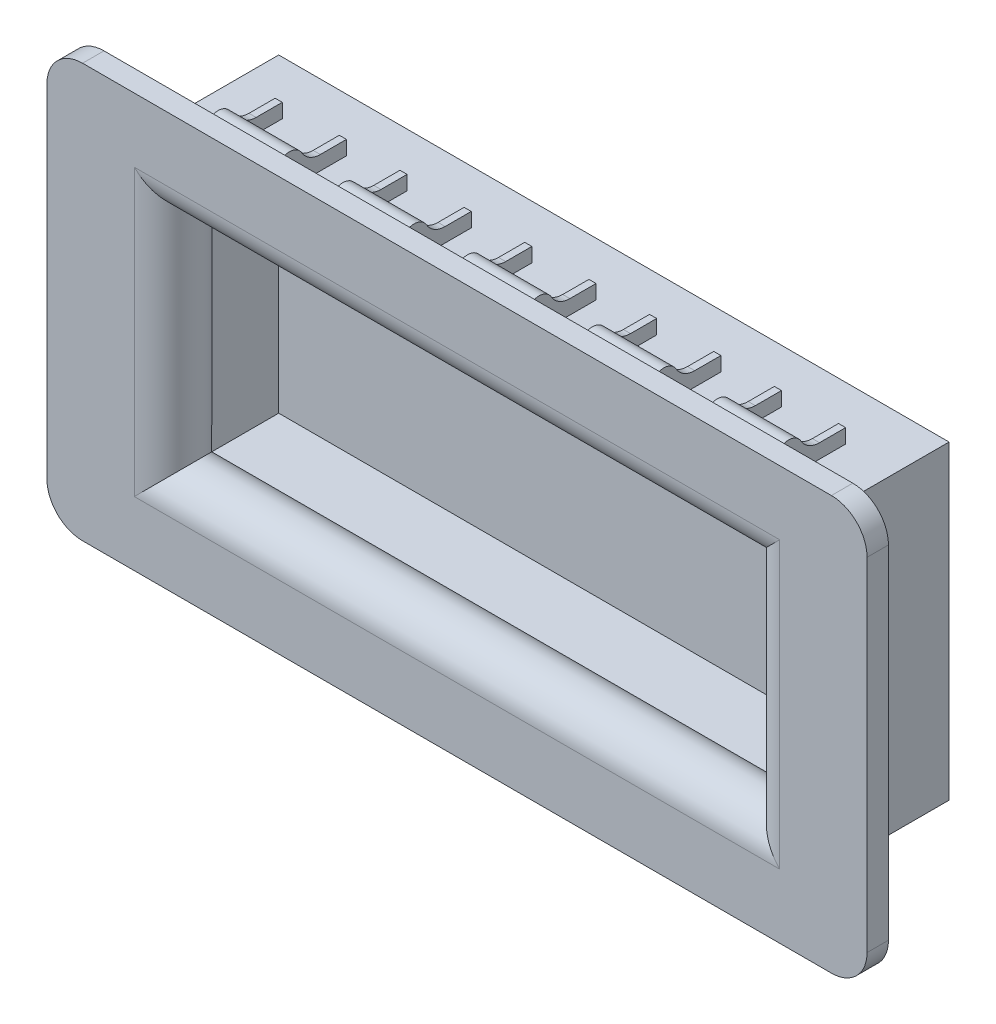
ISO-10303-21;
HEADER;
FILE_DESCRIPTION(('STEP AP214'),'2;1');
FILE_NAME('part.step','',(''),(''),'','','');
FILE_SCHEMA(('AUTOMOTIVE_DESIGN { 1 0 10303 214 1 1 1 1 }'));
ENDSEC;
DATA;
#1=APPLICATION_CONTEXT('core data for automotive mechanical design processes');
#2=APPLICATION_PROTOCOL_DEFINITION('international standard','automotive_design',2000,#1);
#3=PRODUCT_CONTEXT('',#1,'mechanical');
#4=PRODUCT('Part','Part','',(#3));
#5=PRODUCT_RELATED_PRODUCT_CATEGORY('part','',(#4));
#6=PRODUCT_DEFINITION_FORMATION('','',#4);
#7=PRODUCT_DEFINITION_CONTEXT('part definition',#1,'design');
#8=PRODUCT_DEFINITION('design','',#6,#7);
#9=PRODUCT_DEFINITION_SHAPE('','',#8);
#10=(LENGTH_UNIT() NAMED_UNIT(*) SI_UNIT(.MILLI.,.METRE.));
#11=(NAMED_UNIT(*) PLANE_ANGLE_UNIT() SI_UNIT($,.RADIAN.));
#12=(NAMED_UNIT(*) SI_UNIT($,.STERADIAN.) SOLID_ANGLE_UNIT());
#13=UNCERTAINTY_MEASURE_WITH_UNIT(LENGTH_MEASURE(1.E-05),#10,'distance_accuracy_value','');
#14=(GEOMETRIC_REPRESENTATION_CONTEXT(3) GLOBAL_UNCERTAINTY_ASSIGNED_CONTEXT((#13)) GLOBAL_UNIT_ASSIGNED_CONTEXT((#10,
#11,#12)) REPRESENTATION_CONTEXT('',''));
#15=CARTESIAN_POINT('',(0.,0.,0.));
#16=DIRECTION('',(0.,0.,1.));
#17=DIRECTION('',(1.,0.,0.));
#18=AXIS2_PLACEMENT_3D('',#15,#16,#17);
#19=CARTESIAN_POINT('',(30.,26.75,-11.5));
#20=DIRECTION('',(0.,0.,-1.));
#21=DIRECTION('',(0.,-1.,0.));
#22=AXIS2_PLACEMENT_3D('',#19,#20,#21);
#23=PLANE('',#22);
#24=DIRECTION('',(0.,-1.,0.));
#25=VECTOR('',#24,1.);
#26=CARTESIAN_POINT('',(30.,26.75,-11.5));
#27=LINE('',#26,#25);
#28=CARTESIAN_POINT('',(30.,23.75,-11.5));
#29=VERTEX_POINT('',#28);
#30=CARTESIAN_POINT('',(30.,21.75,-11.5));
#31=VERTEX_POINT('',#30);
#32=EDGE_CURVE('E37',#29,#31,#27,.T.);
#33=ORIENTED_EDGE('',*,*,#32,.F.);
#34=DIRECTION('',(1.,0.,0.));
#35=VECTOR('',#34,1.);
#36=CARTESIAN_POINT('',(30.,23.75,-11.5));
#37=LINE('',#36,#35);
#38=CARTESIAN_POINT('',(31.,23.75,-11.5));
#39=VERTEX_POINT('',#38);
#40=EDGE_CURVE('E761',#29,#39,#37,.T.);
#41=ORIENTED_EDGE('',*,*,#40,.T.);
#42=DIRECTION('',(0.,-1.,0.));
#43=VECTOR('',#42,1.);
#44=CARTESIAN_POINT('',(31.,26.75,-11.5));
#45=LINE('',#44,#43);
#46=CARTESIAN_POINT('',(31.,21.75,-11.5));
#47=VERTEX_POINT('',#46);
#48=EDGE_CURVE('E555',#39,#47,#45,.T.);
#49=ORIENTED_EDGE('',*,*,#48,.T.);
#50=DIRECTION('',(1.,0.,0.));
#51=VECTOR('',#50,1.);
#52=CARTESIAN_POINT('',(30.,21.75,-11.5));
#53=LINE('',#52,#51);
#54=EDGE_CURVE('E764',#31,#47,#53,.T.);
#55=ORIENTED_EDGE('',*,*,#54,.F.);
#56=EDGE_LOOP('',(#33,#41,#49,#55));
#57=FACE_BOUND('',#56,.T.);
#58=ADVANCED_FACE('F14',(#57),#23,.T.);
#59=CARTESIAN_POINT('',(31.,26.75,-5.7));
#60=DIRECTION('',(0.,0.,-1.));
#61=DIRECTION('',(1.,0.,0.));
#62=AXIS2_PLACEMENT_3D('',#59,#60,#61);
#63=PLANE('',#62);
#64=DIRECTION('',(0.,-1.,0.));
#65=VECTOR('',#64,1.);
#66=CARTESIAN_POINT('',(31.,26.75,-5.7));
#67=LINE('',#66,#65);
#68=CARTESIAN_POINT('',(31.,24.6375230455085,-5.7));
#69=VERTEX_POINT('',#68);
#70=CARTESIAN_POINT('',(31.,21.75,-5.7));
#71=VERTEX_POINT('',#70);
#72=EDGE_CURVE('E553',#69,#71,#67,.T.);
#73=ORIENTED_EDGE('',*,*,#72,.F.);
#74=DIRECTION('',(1.,0.,0.));
#75=VECTOR('',#74,1.);
#76=CARTESIAN_POINT('',(-47.,24.6375230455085,-5.7));
#77=LINE('',#76,#75);
#78=CARTESIAN_POINT('',(39.,24.6375230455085,-5.7));
#79=VERTEX_POINT('',#78);
#80=EDGE_CURVE('E1050',#69,#79,#77,.T.);
#81=ORIENTED_EDGE('',*,*,#80,.T.);
#82=DIRECTION('',(0.,-1.,0.));
#83=VECTOR('',#82,1.);
#84=CARTESIAN_POINT('',(39.,26.75,-5.7));
#85=LINE('',#84,#83);
#86=CARTESIAN_POINT('',(39.,21.75,-5.7));
#87=VERTEX_POINT('',#86);
#88=EDGE_CURVE('E551',#79,#87,#85,.T.);
#89=ORIENTED_EDGE('',*,*,#88,.T.);
#90=DIRECTION('',(1.,0.,0.));
#91=VECTOR('',#90,1.);
#92=CARTESIAN_POINT('',(31.,21.75,-5.7));
#93=LINE('',#92,#91);
#94=EDGE_CURVE('E1143',#71,#87,#93,.T.);
#95=ORIENTED_EDGE('',*,*,#94,.F.);
#96=EDGE_LOOP('',(#73,#81,#89,#95));
#97=FACE_BOUND('',#96,.T.);
#98=ADVANCED_FACE('F1314',(#97),#63,.T.);
#99=CARTESIAN_POINT('',(39.,26.75,-11.5));
#100=DIRECTION('',(0.,0.,-1.));
#101=DIRECTION('',(0.,-1.,0.));
#102=AXIS2_PLACEMENT_3D('',#99,#100,#101);
#103=PLANE('',#102);
#104=DIRECTION('',(0.,-1.,0.));
#105=VECTOR('',#104,1.);
#106=CARTESIAN_POINT('',(39.,26.75,-11.5));
#107=LINE('',#106,#105);
#108=CARTESIAN_POINT('',(39.,23.75,-11.5));
#109=VERTEX_POINT('',#108);
#110=CARTESIAN_POINT('',(39.,21.75,-11.5));
#111=VERTEX_POINT('',#110);
#112=EDGE_CURVE('E549',#109,#111,#107,.T.);
#113=ORIENTED_EDGE('',*,*,#112,.F.);
#114=DIRECTION('',(1.,0.,0.));
#115=VECTOR('',#114,1.);
#116=CARTESIAN_POINT('',(39.,23.75,-11.5));
#117=LINE('',#116,#115);
#118=CARTESIAN_POINT('',(40.,23.75,-11.5));
#119=VERTEX_POINT('',#118);
#120=EDGE_CURVE('E1131',#109,#119,#117,.T.);
#121=ORIENTED_EDGE('',*,*,#120,.T.);
#122=DIRECTION('',(0.,-1.,0.));
#123=VECTOR('',#122,1.);
#124=CARTESIAN_POINT('',(40.,26.75,-11.5));
#125=LINE('',#124,#123);
#126=CARTESIAN_POINT('',(40.,21.75,-11.5));
#127=VERTEX_POINT('',#126);
#128=EDGE_CURVE('E542',#119,#127,#125,.T.);
#129=ORIENTED_EDGE('',*,*,#128,.T.);
#130=DIRECTION('',(1.,0.,0.));
#131=VECTOR('',#130,1.);
#132=CARTESIAN_POINT('',(39.,21.75,-11.5));
#133=LINE('',#132,#131);
#134=EDGE_CURVE('E1149',#111,#127,#133,.T.);
#135=ORIENTED_EDGE('',*,*,#134,.F.);
#136=EDGE_LOOP('',(#113,#121,#129,#135));
#137=FACE_BOUND('',#136,.T.);
#138=ADVANCED_FACE('F1319',(#137),#103,.T.);
#139=CARTESIAN_POINT('',(40.,26.75,-11.5));
#140=DIRECTION('',(1.,0.,0.));
#141=DIRECTION('',(0.,0.,1.));
#142=AXIS2_PLACEMENT_3D('',#139,#140,#141);
#143=PLANE('',#142);
#144=ORIENTED_EDGE('',*,*,#128,.F.);
#145=DIRECTION('',(0.,0.,1.));
#146=VECTOR('',#145,1.);
#147=CARTESIAN_POINT('',(40.,23.75,-11.5));
#148=LINE('',#147,#146);
#149=CARTESIAN_POINT('',(40.,23.75,-7.8301270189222));
#150=VERTEX_POINT('',#149);
#151=EDGE_CURVE('E1128',#119,#150,#148,.T.);
#152=ORIENTED_EDGE('',*,*,#151,.T.);
#153=CARTESIAN_POINT('',(40.,26.75,-7.8301270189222));
#154=DIRECTION('',(1.,0.,0.));
#155=DIRECTION('',(0.,0.,1.));
#156=AXIS2_PLACEMENT_3D('',#153,#154,#155);
#157=CIRCLE('',#156,3.);
#158=CARTESIAN_POINT('',(40.,25.25,-5.23205080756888));
#159=VERTEX_POINT('',#158);
#160=EDGE_CURVE('E1044',#150,#159,#157,.F.);
#161=ORIENTED_EDGE('',*,*,#160,.T.);
#162=CARTESIAN_POINT('',(40.,24.25,-3.5));
#163=DIRECTION('',(1.,0.,0.));
#164=DIRECTION('',(0.,0.,1.));
#165=AXIS2_PLACEMENT_3D('',#162,#163,#164);
#166=CIRCLE('',#165,2.);
#167=CARTESIAN_POINT('',(40.,25.1018354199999,-1.69047619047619));
#168=VERTEX_POINT('',#167);
#169=EDGE_CURVE('E986',#168,#159,#166,.F.);
#170=ORIENTED_EDGE('',*,*,#169,.F.);
#171=CARTESIAN_POINT('',(40.,25.1444271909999,-1.6));
#172=DIRECTION('',(1.,0.,0.));
#173=DIRECTION('',(0.,0.,1.));
#174=AXIS2_PLACEMENT_3D('',#171,#172,#173);
#175=CIRCLE('',#174,0.1);
#176=CARTESIAN_POINT('',(40.,25.1444271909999,-1.5));
#177=VERTEX_POINT('',#176);
#178=EDGE_CURVE('E1137',#168,#177,#175,.F.);
#179=ORIENTED_EDGE('',*,*,#178,.T.);
#180=DIRECTION('',(0.,-1.,0.));
#181=VECTOR('',#180,1.);
#182=CARTESIAN_POINT('',(40.,26.75,-1.5));
#183=LINE('',#182,#181);
#184=CARTESIAN_POINT('',(40.,21.75,-1.5));
#185=VERTEX_POINT('',#184);
#186=EDGE_CURVE('E533',#177,#185,#183,.T.);
#187=ORIENTED_EDGE('',*,*,#186,.T.);
#188=DIRECTION('',(0.,0.,1.));
#189=VECTOR('',#188,1.);
#190=CARTESIAN_POINT('',(40.,21.75,-11.5));
#191=LINE('',#190,#189);
#192=EDGE_CURVE('E1152',#127,#185,#191,.T.);
#193=ORIENTED_EDGE('',*,*,#192,.F.);
#194=EDGE_LOOP('',(#144,#152,#161,#170,#179,#187,#193));
#195=FACE_BOUND('',#194,.T.);
#196=ADVANCED_FACE('F1158',(#195),#143,.T.);
#197=CARTESIAN_POINT('',(40.,26.75,-1.5));
#198=DIRECTION('',(0.,0.,1.));
#199=DIRECTION('',(0.,1.,0.));
#200=AXIS2_PLACEMENT_3D('',#197,#198,#199);
#201=PLANE('',#200);
#202=ORIENTED_EDGE('',*,*,#186,.F.);
#203=DIRECTION('',(1.,0.,0.));
#204=VECTOR('',#203,1.);
#205=CARTESIAN_POINT('',(-47.,25.1444271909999,-1.5));
#206=LINE('',#205,#204);
#207=CARTESIAN_POINT('',(-40.,25.1444271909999,-1.5));
#208=VERTEX_POINT('',#207);
#209=EDGE_CURVE('E520',#208,#177,#206,.T.);
#210=ORIENTED_EDGE('',*,*,#209,.F.);
#211=DIRECTION('',(0.,-1.,0.));
#212=VECTOR('',#211,1.);
#213=CARTESIAN_POINT('',(-40.,26.75,-1.5));
#214=LINE('',#213,#212);
#215=CARTESIAN_POINT('',(-40.,21.75,-1.5));
#216=VERTEX_POINT('',#215);
#217=EDGE_CURVE('E531',#208,#216,#214,.T.);
#218=ORIENTED_EDGE('',*,*,#217,.T.);
#219=DIRECTION('',(-1.,0.,0.));
#220=VECTOR('',#219,1.);
#221=CARTESIAN_POINT('',(40.,21.75,-1.5));
#222=LINE('',#221,#220);
#223=EDGE_CURVE('E856',#185,#216,#222,.T.);
#224=ORIENTED_EDGE('',*,*,#223,.F.);
#225=EDGE_LOOP('',(#202,#210,#218,#224));
#226=FACE_BOUND('',#225,.T.);
#227=ADVANCED_FACE('F529',(#226),#201,.T.);
#228=CARTESIAN_POINT('',(-40.,26.75,-1.5));
#229=DIRECTION('',(-1.,0.,0.));
#230=DIRECTION('',(0.,0.,-1.));
#231=AXIS2_PLACEMENT_3D('',#228,#229,#230);
#232=PLANE('',#231);
#233=CARTESIAN_POINT('',(-40.,26.75,-7.8301270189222));
#234=DIRECTION('',(-1.,0.,0.));
#235=DIRECTION('',(0.,0.,-1.));
#236=AXIS2_PLACEMENT_3D('',#233,#234,#235);
#237=CIRCLE('',#236,3.);
#238=CARTESIAN_POINT('',(-40.,25.25,-5.23205080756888));
#239=VERTEX_POINT('',#238);
#240=CARTESIAN_POINT('',(-40.,23.75,-7.8301270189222));
#241=VERTEX_POINT('',#240);
#242=EDGE_CURVE('E1042',#239,#241,#237,.F.);
#243=ORIENTED_EDGE('',*,*,#242,.T.);
#244=DIRECTION('',(0.,0.,-1.));
#245=VECTOR('',#244,1.);
#246=CARTESIAN_POINT('',(-40.,23.75,-1.5));
#247=LINE('',#246,#245);
#248=CARTESIAN_POINT('',(-40.,23.75,-11.5));
#249=VERTEX_POINT('',#248);
#250=EDGE_CURVE('E1125',#241,#249,#247,.T.);
#251=ORIENTED_EDGE('',*,*,#250,.T.);
#252=DIRECTION('',(0.,-1.,0.));
#253=VECTOR('',#252,1.);
#254=CARTESIAN_POINT('',(-40.,26.75,-11.5));
#255=LINE('',#254,#253);
#256=CARTESIAN_POINT('',(-40.,21.75,-11.5));
#257=VERTEX_POINT('',#256);
#258=EDGE_CURVE('E540',#249,#257,#255,.T.);
#259=ORIENTED_EDGE('',*,*,#258,.T.);
#260=DIRECTION('',(0.,0.,-1.));
#261=VECTOR('',#260,1.);
#262=CARTESIAN_POINT('',(-40.,21.75,-1.5));
#263=LINE('',#262,#261);
#264=EDGE_CURVE('E538',#216,#257,#263,.T.);
#265=ORIENTED_EDGE('',*,*,#264,.F.);
#266=ORIENTED_EDGE('',*,*,#217,.F.);
#267=CARTESIAN_POINT('',(-40.,25.1444271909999,-1.6));
#268=DIRECTION('',(-1.,0.,0.));
#269=DIRECTION('',(0.,0.,-1.));
#270=AXIS2_PLACEMENT_3D('',#267,#268,#269);
#271=CIRCLE('',#270,0.1);
#272=CARTESIAN_POINT('',(-40.,25.1018354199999,-1.69047619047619));
#273=VERTEX_POINT('',#272);
#274=EDGE_CURVE('E9',#208,#273,#271,.F.);
#275=ORIENTED_EDGE('',*,*,#274,.T.);
#276=CARTESIAN_POINT('',(-40.,24.25,-3.5));
#277=DIRECTION('',(-1.,0.,0.));
#278=DIRECTION('',(0.,0.,-1.));
#279=AXIS2_PLACEMENT_3D('',#276,#277,#278);
#280=CIRCLE('',#279,2.);
#281=EDGE_CURVE('E984',#239,#273,#280,.F.);
#282=ORIENTED_EDGE('',*,*,#281,.F.);
#283=EDGE_LOOP('',(#243,#251,#259,#265,#266,#275,#282));
#284=FACE_BOUND('',#283,.T.);
#285=ADVANCED_FACE('F536',(#284),#232,.T.);
#286=CARTESIAN_POINT('',(-40.,26.75,-11.5));
#287=DIRECTION('',(0.,0.,-1.));
#288=DIRECTION('',(0.,-1.,0.));
#289=AXIS2_PLACEMENT_3D('',#286,#287,#288);
#290=PLANE('',#289);
#291=ORIENTED_EDGE('',*,*,#258,.F.);
#292=DIRECTION('',(1.,0.,0.));
#293=VECTOR('',#292,1.);
#294=CARTESIAN_POINT('',(-40.,23.75,-11.5));
#295=LINE('',#294,#293);
#296=CARTESIAN_POINT('',(-39.,23.75,-11.5));
#297=VERTEX_POINT('',#296);
#298=EDGE_CURVE('E840',#249,#297,#295,.T.);
#299=ORIENTED_EDGE('',*,*,#298,.T.);
#300=DIRECTION('',(0.,-1.,0.));
#301=VECTOR('',#300,1.);
#302=CARTESIAN_POINT('',(-39.,26.75,-11.5));
#303=LINE('',#302,#301);
#304=CARTESIAN_POINT('',(-39.,21.75,-11.5));
#305=VERTEX_POINT('',#304);
#306=EDGE_CURVE('E544',#297,#305,#303,.T.);
#307=ORIENTED_EDGE('',*,*,#306,.T.);
#308=DIRECTION('',(1.,0.,0.));
#309=VECTOR('',#308,1.);
#310=CARTESIAN_POINT('',(-40.,21.75,-11.5));
#311=LINE('',#310,#309);
#312=EDGE_CURVE('E839',#257,#305,#311,.T.);
#313=ORIENTED_EDGE('',*,*,#312,.F.);
#314=EDGE_LOOP('',(#291,#299,#307,#313));
#315=FACE_BOUND('',#314,.T.);
#316=ADVANCED_FACE('F837',(#315),#290,.T.);
#317=CARTESIAN_POINT('',(-39.,26.75,-5.7));
#318=DIRECTION('',(0.,0.,-1.));
#319=DIRECTION('',(0.,-1.,0.));
#320=AXIS2_PLACEMENT_3D('',#317,#318,#319);
#321=PLANE('',#320);
#322=DIRECTION('',(0.,-1.,0.));
#323=VECTOR('',#322,1.);
#324=CARTESIAN_POINT('',(-39.,26.75,-5.7));
#325=LINE('',#324,#323);
#326=CARTESIAN_POINT('',(-39.,24.6375230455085,-5.7));
#327=VERTEX_POINT('',#326);
#328=CARTESIAN_POINT('',(-39.,21.75,-5.7));
#329=VERTEX_POINT('',#328);
#330=EDGE_CURVE('E830',#327,#329,#325,.T.);
#331=ORIENTED_EDGE('',*,*,#330,.F.);
#332=DIRECTION('',(1.,0.,0.));
#333=VECTOR('',#332,1.);
#334=CARTESIAN_POINT('',(-47.,24.6375230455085,-5.7));
#335=LINE('',#334,#333);
#336=CARTESIAN_POINT('',(-31.,24.6375230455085,-5.7));
#337=VERTEX_POINT('',#336);
#338=EDGE_CURVE('E1037',#327,#337,#335,.T.);
#339=ORIENTED_EDGE('',*,*,#338,.T.);
#340=DIRECTION('',(0.,-1.,0.));
#341=VECTOR('',#340,1.);
#342=CARTESIAN_POINT('',(-31.,26.75,-5.7));
#343=LINE('',#342,#341);
#344=CARTESIAN_POINT('',(-31.,21.75,-5.7));
#345=VERTEX_POINT('',#344);
#346=EDGE_CURVE('E828',#337,#345,#343,.T.);
#347=ORIENTED_EDGE('',*,*,#346,.T.);
#348=DIRECTION('',(1.,0.,0.));
#349=VECTOR('',#348,1.);
#350=CARTESIAN_POINT('',(-39.,21.75,-5.7));
#351=LINE('',#350,#349);
#352=EDGE_CURVE('E851',#329,#345,#351,.T.);
#353=ORIENTED_EDGE('',*,*,#352,.F.);
#354=EDGE_LOOP('',(#331,#339,#347,#353));
#355=FACE_BOUND('',#354,.T.);
#356=ADVANCED_FACE('F1291',(#355),#321,.T.);
#357=CARTESIAN_POINT('',(-31.,26.75,-11.5));
#358=DIRECTION('',(0.,0.,-1.));
#359=DIRECTION('',(0.,-1.,0.));
#360=AXIS2_PLACEMENT_3D('',#357,#358,#359);
#361=PLANE('',#360);
#362=DIRECTION('',(0.,-1.,0.));
#363=VECTOR('',#362,1.);
#364=CARTESIAN_POINT('',(-31.,26.75,-11.5));
#365=LINE('',#364,#363);
#366=CARTESIAN_POINT('',(-31.,23.75,-11.5));
#367=VERTEX_POINT('',#366);
#368=CARTESIAN_POINT('',(-31.,21.75,-11.5));
#369=VERTEX_POINT('',#368);
#370=EDGE_CURVE('E826',#367,#369,#365,.T.);
#371=ORIENTED_EDGE('',*,*,#370,.F.);
#372=DIRECTION('',(1.,0.,0.));
#373=VECTOR('',#372,1.);
#374=CARTESIAN_POINT('',(-31.,23.75,-11.5));
#375=LINE('',#374,#373);
#376=CARTESIAN_POINT('',(-30.,23.75,-11.5));
#377=VERTEX_POINT('',#376);
#378=EDGE_CURVE('E1116',#367,#377,#375,.T.);
#379=ORIENTED_EDGE('',*,*,#378,.T.);
#380=DIRECTION('',(0.,-1.,0.));
#381=VECTOR('',#380,1.);
#382=CARTESIAN_POINT('',(-30.,26.75,-11.5));
#383=LINE('',#382,#381);
#384=CARTESIAN_POINT('',(-30.,21.75,-11.5));
#385=VERTEX_POINT('',#384);
#386=EDGE_CURVE('E824',#377,#385,#383,.T.);
#387=ORIENTED_EDGE('',*,*,#386,.T.);
#388=DIRECTION('',(1.,0.,0.));
#389=VECTOR('',#388,1.);
#390=CARTESIAN_POINT('',(-31.,21.75,-11.5));
#391=LINE('',#390,#389);
#392=EDGE_CURVE('E864',#369,#385,#391,.T.);
#393=ORIENTED_EDGE('',*,*,#392,.F.);
#394=EDGE_LOOP('',(#371,#379,#387,#393));
#395=FACE_BOUND('',#394,.T.);
#396=ADVANCED_FACE('F1299',(#395),#361,.T.);
#397=CARTESIAN_POINT('',(-22.5,26.75,-11.5));
#398=DIRECTION('',(0.,0.,-1.));
#399=DIRECTION('',(0.,-1.,0.));
#400=AXIS2_PLACEMENT_3D('',#397,#398,#399);
#401=PLANE('',#400);
#402=DIRECTION('',(0.,-1.,0.));
#403=VECTOR('',#402,1.);
#404=CARTESIAN_POINT('',(-22.5,26.75,-11.5));
#405=LINE('',#404,#403);
#406=CARTESIAN_POINT('',(-22.5,23.75,-11.5));
#407=VERTEX_POINT('',#406);
#408=CARTESIAN_POINT('',(-22.5,21.75,-11.5));
#409=VERTEX_POINT('',#408);
#410=EDGE_CURVE('E818',#407,#409,#405,.T.);
#411=ORIENTED_EDGE('',*,*,#410,.F.);
#412=DIRECTION('',(1.,0.,0.));
#413=VECTOR('',#412,1.);
#414=CARTESIAN_POINT('',(-22.5,23.75,-11.5));
#415=LINE('',#414,#413);
#416=CARTESIAN_POINT('',(-21.5,23.75,-11.5));
#417=VERTEX_POINT('',#416);
#418=EDGE_CURVE('E1107',#407,#417,#415,.T.);
#419=ORIENTED_EDGE('',*,*,#418,.T.);
#420=DIRECTION('',(0.,-1.,0.));
#421=VECTOR('',#420,1.);
#422=CARTESIAN_POINT('',(-21.5,26.75,-11.5));
#423=LINE('',#422,#421);
#424=CARTESIAN_POINT('',(-21.5,21.75,-11.5));
#425=VERTEX_POINT('',#424);
#426=EDGE_CURVE('E816',#417,#425,#423,.T.);
#427=ORIENTED_EDGE('',*,*,#426,.T.);
#428=DIRECTION('',(1.,0.,0.));
#429=VECTOR('',#428,1.);
#430=CARTESIAN_POINT('',(-22.5,21.75,-11.5));
#431=LINE('',#430,#429);
#432=EDGE_CURVE('E876',#409,#425,#431,.T.);
#433=ORIENTED_EDGE('',*,*,#432,.F.);
#434=EDGE_LOOP('',(#411,#419,#427,#433));
#435=FACE_BOUND('',#434,.T.);
#436=ADVANCED_FACE('F1593',(#435),#401,.T.);
#437=CARTESIAN_POINT('',(-21.5,26.75,-5.7));
#438=DIRECTION('',(0.,0.,-1.));
#439=DIRECTION('',(0.,-1.,0.));
#440=AXIS2_PLACEMENT_3D('',#437,#438,#439);
#441=PLANE('',#440);
#442=DIRECTION('',(0.,-1.,0.));
#443=VECTOR('',#442,1.);
#444=CARTESIAN_POINT('',(-21.5,26.75,-5.7));
#445=LINE('',#444,#443);
#446=CARTESIAN_POINT('',(-21.5,24.6375230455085,-5.7));
#447=VERTEX_POINT('',#446);
#448=CARTESIAN_POINT('',(-21.5,21.75,-5.7));
#449=VERTEX_POINT('',#448);
#450=EDGE_CURVE('E814',#447,#449,#445,.T.);
#451=ORIENTED_EDGE('',*,*,#450,.F.);
#452=DIRECTION('',(1.,0.,0.));
#453=VECTOR('',#452,1.);
#454=CARTESIAN_POINT('',(-47.,24.6375230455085,-5.7));
#455=LINE('',#454,#453);
#456=CARTESIAN_POINT('',(-13.5,24.6375230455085,-5.7));
#457=VERTEX_POINT('',#456);
#458=EDGE_CURVE('E1022',#447,#457,#455,.T.);
#459=ORIENTED_EDGE('',*,*,#458,.T.);
#460=DIRECTION('',(0.,-1.,0.));
#461=VECTOR('',#460,1.);
#462=CARTESIAN_POINT('',(-13.5,26.75,-5.7));
#463=LINE('',#462,#461);
#464=CARTESIAN_POINT('',(-13.5,21.75,-5.7));
#465=VERTEX_POINT('',#464);
#466=EDGE_CURVE('E812',#457,#465,#463,.T.);
#467=ORIENTED_EDGE('',*,*,#466,.T.);
#468=DIRECTION('',(1.,0.,0.));
#469=VECTOR('',#468,1.);
#470=CARTESIAN_POINT('',(-21.5,21.75,-5.7));
#471=LINE('',#470,#469);
#472=EDGE_CURVE('E882',#449,#465,#471,.T.);
#473=ORIENTED_EDGE('',*,*,#472,.F.);
#474=EDGE_LOOP('',(#451,#459,#467,#473));
#475=FACE_BOUND('',#474,.T.);
#476=ADVANCED_FACE('F1266',(#475),#441,.T.);
#477=CARTESIAN_POINT('',(-13.5,26.75,-11.5));
#478=DIRECTION('',(0.,0.,-1.));
#479=DIRECTION('',(0.,-1.,0.));
#480=AXIS2_PLACEMENT_3D('',#477,#478,#479);
#481=PLANE('',#480);
#482=DIRECTION('',(0.,-1.,0.));
#483=VECTOR('',#482,1.);
#484=CARTESIAN_POINT('',(-13.5,26.75,-11.5));
#485=LINE('',#484,#483);
#486=CARTESIAN_POINT('',(-13.5,23.75,-11.5));
#487=VERTEX_POINT('',#486);
#488=CARTESIAN_POINT('',(-13.5,21.75,-11.5));
#489=VERTEX_POINT('',#488);
#490=EDGE_CURVE('E810',#487,#489,#485,.T.);
#491=ORIENTED_EDGE('',*,*,#490,.F.);
#492=DIRECTION('',(1.,0.,0.));
#493=VECTOR('',#492,1.);
#494=CARTESIAN_POINT('',(-13.5,23.75,-11.5));
#495=LINE('',#494,#493);
#496=CARTESIAN_POINT('',(-12.5,23.75,-11.5));
#497=VERTEX_POINT('',#496);
#498=EDGE_CURVE('E1098',#487,#497,#495,.T.);
#499=ORIENTED_EDGE('',*,*,#498,.T.);
#500=DIRECTION('',(0.,-1.,0.));
#501=VECTOR('',#500,1.);
#502=CARTESIAN_POINT('',(-12.5,26.75,-11.5));
#503=LINE('',#502,#501);
#504=CARTESIAN_POINT('',(-12.5,21.75,-11.5));
#505=VERTEX_POINT('',#504);
#506=EDGE_CURVE('E808',#497,#505,#503,.T.);
#507=ORIENTED_EDGE('',*,*,#506,.T.);
#508=DIRECTION('',(1.,0.,0.));
#509=VECTOR('',#508,1.);
#510=CARTESIAN_POINT('',(-13.5,21.75,-11.5));
#511=LINE('',#510,#509);
#512=EDGE_CURVE('E888',#489,#505,#511,.T.);
#513=ORIENTED_EDGE('',*,*,#512,.F.);
#514=EDGE_LOOP('',(#491,#499,#507,#513));
#515=FACE_BOUND('',#514,.T.);
#516=ADVANCED_FACE('F1258',(#515),#481,.T.);
#517=CARTESIAN_POINT('',(-5.,26.75,-11.5));
#518=DIRECTION('',(0.,0.,-1.));
#519=DIRECTION('',(0.,-1.,0.));
#520=AXIS2_PLACEMENT_3D('',#517,#518,#519);
#521=PLANE('',#520);
#522=DIRECTION('',(0.,-1.,0.));
#523=VECTOR('',#522,1.);
#524=CARTESIAN_POINT('',(-5.,26.75,-11.5));
#525=LINE('',#524,#523);
#526=CARTESIAN_POINT('',(-5.,23.75,-11.5));
#527=VERTEX_POINT('',#526);
#528=CARTESIAN_POINT('',(-5.,21.75,-11.5));
#529=VERTEX_POINT('',#528);
#530=EDGE_CURVE('E802',#527,#529,#525,.T.);
#531=ORIENTED_EDGE('',*,*,#530,.F.);
#532=DIRECTION('',(1.,0.,0.));
#533=VECTOR('',#532,1.);
#534=CARTESIAN_POINT('',(-5.,23.75,-11.5));
#535=LINE('',#534,#533);
#536=CARTESIAN_POINT('',(-4.,23.75,-11.5));
#537=VERTEX_POINT('',#536);
#538=EDGE_CURVE('E1089',#527,#537,#535,.T.);
#539=ORIENTED_EDGE('',*,*,#538,.T.);
#540=DIRECTION('',(0.,-1.,0.));
#541=VECTOR('',#540,1.);
#542=CARTESIAN_POINT('',(-4.,26.75,-11.5));
#543=LINE('',#542,#541);
#544=CARTESIAN_POINT('',(-4.,21.75,-11.5));
#545=VERTEX_POINT('',#544);
#546=EDGE_CURVE('E800',#537,#545,#543,.T.);
#547=ORIENTED_EDGE('',*,*,#546,.T.);
#548=DIRECTION('',(1.,0.,0.));
#549=VECTOR('',#548,1.);
#550=CARTESIAN_POINT('',(-5.,21.75,-11.5));
#551=LINE('',#550,#549);
#552=EDGE_CURVE('E900',#529,#545,#551,.T.);
#553=ORIENTED_EDGE('',*,*,#552,.F.);
#554=EDGE_LOOP('',(#531,#539,#547,#553));
#555=FACE_BOUND('',#554,.T.);
#556=ADVANCED_FACE('F1572',(#555),#521,.T.);
#557=CARTESIAN_POINT('',(-4.,26.75,-5.7));
#558=DIRECTION('',(0.,0.,-1.));
#559=DIRECTION('',(0.,-1.,0.));
#560=AXIS2_PLACEMENT_3D('',#557,#558,#559);
#561=PLANE('',#560);
#562=DIRECTION('',(0.,-1.,0.));
#563=VECTOR('',#562,1.);
#564=CARTESIAN_POINT('',(-4.,26.75,-5.7));
#565=LINE('',#564,#563);
#566=CARTESIAN_POINT('',(-4.,24.6375230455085,-5.7));
#567=VERTEX_POINT('',#566);
#568=CARTESIAN_POINT('',(-4.,21.75,-5.7));
#569=VERTEX_POINT('',#568);
#570=EDGE_CURVE('E798',#567,#569,#565,.T.);
#571=ORIENTED_EDGE('',*,*,#570,.F.);
#572=DIRECTION('',(1.,0.,0.));
#573=VECTOR('',#572,1.);
#574=CARTESIAN_POINT('',(-47.,24.6375230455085,-5.7));
#575=LINE('',#574,#573);
#576=CARTESIAN_POINT('',(4.,24.6375230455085,-5.7));
#577=VERTEX_POINT('',#576);
#578=EDGE_CURVE('E1007',#567,#577,#575,.T.);
#579=ORIENTED_EDGE('',*,*,#578,.T.);
#580=DIRECTION('',(0.,-1.,0.));
#581=VECTOR('',#580,1.);
#582=CARTESIAN_POINT('',(4.,26.75,-5.7));
#583=LINE('',#582,#581);
#584=CARTESIAN_POINT('',(4.,21.75,-5.7));
#585=VERTEX_POINT('',#584);
#586=EDGE_CURVE('E796',#577,#585,#583,.T.);
#587=ORIENTED_EDGE('',*,*,#586,.T.);
#588=DIRECTION('',(1.,0.,0.));
#589=VECTOR('',#588,1.);
#590=CARTESIAN_POINT('',(-4.,21.75,-5.7));
#591=LINE('',#590,#589);
#592=EDGE_CURVE('E906',#569,#585,#591,.T.);
#593=ORIENTED_EDGE('',*,*,#592,.F.);
#594=EDGE_LOOP('',(#571,#579,#587,#593));
#595=FACE_BOUND('',#594,.T.);
#596=ADVANCED_FACE('F1564',(#595),#561,.T.);
#597=CARTESIAN_POINT('',(4.,26.75,-11.5));
#598=DIRECTION('',(0.,0.,-1.));
#599=DIRECTION('',(0.,-1.,0.));
#600=AXIS2_PLACEMENT_3D('',#597,#598,#599);
#601=PLANE('',#600);
#602=DIRECTION('',(0.,-1.,0.));
#603=VECTOR('',#602,1.);
#604=CARTESIAN_POINT('',(4.,26.75,-11.5));
#605=LINE('',#604,#603);
#606=CARTESIAN_POINT('',(4.,23.75,-11.5));
#607=VERTEX_POINT('',#606);
#608=CARTESIAN_POINT('',(4.,21.75,-11.5));
#609=VERTEX_POINT('',#608);
#610=EDGE_CURVE('E794',#607,#609,#605,.T.);
#611=ORIENTED_EDGE('',*,*,#610,.F.);
#612=DIRECTION('',(1.,0.,0.));
#613=VECTOR('',#612,1.);
#614=CARTESIAN_POINT('',(4.,23.75,-11.5));
#615=LINE('',#614,#613);
#616=CARTESIAN_POINT('',(5.,23.75,-11.5));
#617=VERTEX_POINT('',#616);
#618=EDGE_CURVE('E1080',#607,#617,#615,.T.);
#619=ORIENTED_EDGE('',*,*,#618,.T.);
#620=DIRECTION('',(0.,-1.,0.));
#621=VECTOR('',#620,1.);
#622=CARTESIAN_POINT('',(5.,26.75,-11.5));
#623=LINE('',#622,#621);
#624=CARTESIAN_POINT('',(5.,21.75,-11.5));
#625=VERTEX_POINT('',#624);
#626=EDGE_CURVE('E792',#617,#625,#623,.T.);
#627=ORIENTED_EDGE('',*,*,#626,.T.);
#628=DIRECTION('',(1.,0.,0.));
#629=VECTOR('',#628,1.);
#630=CARTESIAN_POINT('',(4.,21.75,-11.5));
#631=LINE('',#630,#629);
#632=EDGE_CURVE('E912',#609,#625,#631,.T.);
#633=ORIENTED_EDGE('',*,*,#632,.F.);
#634=EDGE_LOOP('',(#611,#619,#627,#633));
#635=FACE_BOUND('',#634,.T.);
#636=ADVANCED_FACE('F1556',(#635),#601,.T.);
#637=CARTESIAN_POINT('',(12.5,26.75,-11.5));
#638=DIRECTION('',(0.,0.,-1.));
#639=DIRECTION('',(0.,-1.,0.));
#640=AXIS2_PLACEMENT_3D('',#637,#638,#639);
#641=PLANE('',#640);
#642=DIRECTION('',(0.,-1.,0.));
#643=VECTOR('',#642,1.);
#644=CARTESIAN_POINT('',(12.5,26.75,-11.5));
#645=LINE('',#644,#643);
#646=CARTESIAN_POINT('',(12.5,23.75,-11.5));
#647=VERTEX_POINT('',#646);
#648=CARTESIAN_POINT('',(12.5,21.75,-11.5));
#649=VERTEX_POINT('',#648);
#650=EDGE_CURVE('E786',#647,#649,#645,.T.);
#651=ORIENTED_EDGE('',*,*,#650,.F.);
#652=DIRECTION('',(1.,0.,0.));
#653=VECTOR('',#652,1.);
#654=CARTESIAN_POINT('',(12.5,23.75,-11.5));
#655=LINE('',#654,#653);
#656=CARTESIAN_POINT('',(13.5,23.75,-11.5));
#657=VERTEX_POINT('',#656);
#658=EDGE_CURVE('E1071',#647,#657,#655,.T.);
#659=ORIENTED_EDGE('',*,*,#658,.T.);
#660=DIRECTION('',(0.,-1.,0.));
#661=VECTOR('',#660,1.);
#662=CARTESIAN_POINT('',(13.5,26.75,-11.5));
#663=LINE('',#662,#661);
#664=CARTESIAN_POINT('',(13.5,21.75,-11.5));
#665=VERTEX_POINT('',#664);
#666=EDGE_CURVE('E784',#657,#665,#663,.T.);
#667=ORIENTED_EDGE('',*,*,#666,.T.);
#668=DIRECTION('',(1.,0.,0.));
#669=VECTOR('',#668,1.);
#670=CARTESIAN_POINT('',(12.5,21.75,-11.5));
#671=LINE('',#670,#669);
#672=EDGE_CURVE('E924',#649,#665,#671,.T.);
#673=ORIENTED_EDGE('',*,*,#672,.F.);
#674=EDGE_LOOP('',(#651,#659,#667,#673));
#675=FACE_BOUND('',#674,.T.);
#676=ADVANCED_FACE('F1549',(#675),#641,.T.);
#677=CARTESIAN_POINT('',(13.5,26.75,-5.7));
#678=DIRECTION('',(0.,0.,-1.));
#679=DIRECTION('',(0.,-1.,0.));
#680=AXIS2_PLACEMENT_3D('',#677,#678,#679);
#681=PLANE('',#680);
#682=DIRECTION('',(0.,-1.,0.));
#683=VECTOR('',#682,1.);
#684=CARTESIAN_POINT('',(13.5,26.75,-5.7));
#685=LINE('',#684,#683);
#686=CARTESIAN_POINT('',(13.5,24.6375230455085,-5.7));
#687=VERTEX_POINT('',#686);
#688=CARTESIAN_POINT('',(13.5,21.75,-5.7));
#689=VERTEX_POINT('',#688);
#690=EDGE_CURVE('E782',#687,#689,#685,.T.);
#691=ORIENTED_EDGE('',*,*,#690,.F.);
#692=DIRECTION('',(1.,0.,0.));
#693=VECTOR('',#692,1.);
#694=CARTESIAN_POINT('',(-47.,24.6375230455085,-5.7));
#695=LINE('',#694,#693);
#696=CARTESIAN_POINT('',(21.5,24.6375230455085,-5.7));
#697=VERTEX_POINT('',#696);
#698=EDGE_CURVE('E992',#687,#697,#695,.T.);
#699=ORIENTED_EDGE('',*,*,#698,.T.);
#700=DIRECTION('',(0.,-1.,0.));
#701=VECTOR('',#700,1.);
#702=CARTESIAN_POINT('',(21.5,26.75,-5.7));
#703=LINE('',#702,#701);
#704=CARTESIAN_POINT('',(21.5,21.75,-5.7));
#705=VERTEX_POINT('',#704);
#706=EDGE_CURVE('E780',#697,#705,#703,.T.);
#707=ORIENTED_EDGE('',*,*,#706,.T.);
#708=DIRECTION('',(1.,0.,0.));
#709=VECTOR('',#708,1.);
#710=CARTESIAN_POINT('',(13.5,21.75,-5.7));
#711=LINE('',#710,#709);
#712=EDGE_CURVE('E930',#689,#705,#711,.T.);
#713=ORIENTED_EDGE('',*,*,#712,.F.);
#714=EDGE_LOOP('',(#691,#699,#707,#713));
#715=FACE_BOUND('',#714,.T.);
#716=ADVANCED_FACE('F1216',(#715),#681,.T.);
#717=CARTESIAN_POINT('',(21.5,26.75,-11.5));
#718=DIRECTION('',(0.,0.,-1.));
#719=DIRECTION('',(0.,-1.,0.));
#720=AXIS2_PLACEMENT_3D('',#717,#718,#719);
#721=PLANE('',#720);
#722=DIRECTION('',(0.,-1.,0.));
#723=VECTOR('',#722,1.);
#724=CARTESIAN_POINT('',(21.5,26.75,-11.5));
#725=LINE('',#724,#723);
#726=CARTESIAN_POINT('',(21.5,23.75,-11.5));
#727=VERTEX_POINT('',#726);
#728=CARTESIAN_POINT('',(21.5,21.75,-11.5));
#729=VERTEX_POINT('',#728);
#730=EDGE_CURVE('E778',#727,#729,#725,.T.);
#731=ORIENTED_EDGE('',*,*,#730,.F.);
#732=DIRECTION('',(1.,0.,0.));
#733=VECTOR('',#732,1.);
#734=CARTESIAN_POINT('',(21.5,23.75,-11.5));
#735=LINE('',#734,#733);
#736=CARTESIAN_POINT('',(22.5,23.75,-11.5));
#737=VERTEX_POINT('',#736);
#738=EDGE_CURVE('E1062',#727,#737,#735,.T.);
#739=ORIENTED_EDGE('',*,*,#738,.T.);
#740=DIRECTION('',(0.,-1.,0.));
#741=VECTOR('',#740,1.);
#742=CARTESIAN_POINT('',(22.5,26.75,-11.5));
#743=LINE('',#742,#741);
#744=CARTESIAN_POINT('',(22.5,21.75,-11.5));
#745=VERTEX_POINT('',#744);
#746=EDGE_CURVE('E776',#737,#745,#743,.T.);
#747=ORIENTED_EDGE('',*,*,#746,.T.);
#748=DIRECTION('',(1.,0.,0.));
#749=VECTOR('',#748,1.);
#750=CARTESIAN_POINT('',(21.5,21.75,-11.5));
#751=LINE('',#750,#749);
#752=EDGE_CURVE('E936',#729,#745,#751,.T.);
#753=ORIENTED_EDGE('',*,*,#752,.F.);
#754=EDGE_LOOP('',(#731,#739,#747,#753));
#755=FACE_BOUND('',#754,.T.);
#756=ADVANCED_FACE('F1208',(#755),#721,.T.);
#757=CARTESIAN_POINT('',(-47.,20.,-1.5));
#758=DIRECTION('',(1.,0.,0.));
#759=DIRECTION('',(0.,0.,1.));
#760=AXIS2_PLACEMENT_3D('',#757,#758,#759);
#761=CYLINDRICAL_SURFACE('',#760,4.5);
#762=CARTESIAN_POINT('',(-45.25,20.,-1.5));
#763=DIRECTION('',(0.707106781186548,0.707106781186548,0.));
#764=DIRECTION('',(0.707106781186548,-0.707106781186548,0.));
#765=AXIS2_PLACEMENT_3D('',#762,#763,#764);
#766=ELLIPSE('',#765,6.36396103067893,4.5);
#767=CARTESIAN_POINT('',(-45.25,20.,-6.));
#768=VERTEX_POINT('',#767);
#769=CARTESIAN_POINT('',(-45.25,20.,3.));
#770=VERTEX_POINT('',#769);
#771=EDGE_CURVE('E561',#768,#770,#766,.F.);
#772=ORIENTED_EDGE('',*,*,#771,.F.);
#773=DIRECTION('',(1.,0.,0.));
#774=VECTOR('',#773,1.);
#775=CARTESIAN_POINT('',(-47.,20.,-6.));
#776=LINE('',#775,#774);
#777=CARTESIAN_POINT('',(45.25,20.,-6.));
#778=VERTEX_POINT('',#777);
#779=EDGE_CURVE('E614',#768,#778,#776,.T.);
#780=ORIENTED_EDGE('',*,*,#779,.T.);
#781=CARTESIAN_POINT('',(45.25,20.,-1.5));
#782=DIRECTION('',(0.707106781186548,-0.707106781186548,0.));
#783=DIRECTION('',(0.707106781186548,0.707106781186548,0.));
#784=AXIS2_PLACEMENT_3D('',#781,#782,#783);
#785=ELLIPSE('',#784,6.36396103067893,4.5);
#786=CARTESIAN_POINT('',(45.25,20.,3.));
#787=VERTEX_POINT('',#786);
#788=EDGE_CURVE('E565',#787,#778,#785,.T.);
#789=ORIENTED_EDGE('',*,*,#788,.F.);
#790=DIRECTION('',(1.,0.,0.));
#791=VECTOR('',#790,1.);
#792=CARTESIAN_POINT('',(-45.25,20.,3.));
#793=LINE('',#792,#791);
#794=EDGE_CURVE('E631',#770,#787,#793,.T.);
#795=ORIENTED_EDGE('',*,*,#794,.F.);
#796=EDGE_LOOP('',(#772,#780,#789,#795));
#797=FACE_BOUND('',#796,.T.);
#798=ADVANCED_FACE('F1370',(#797),#761,.T.);
#799=CARTESIAN_POINT('',(-47.,-20.,-1.5));
#800=DIRECTION('',(1.,0.,0.));
#801=DIRECTION('',(0.,0.,1.));
#802=AXIS2_PLACEMENT_3D('',#799,#800,#801);
#803=CYLINDRICAL_SURFACE('',#802,4.5);
#804=CARTESIAN_POINT('',(-45.25,-20.,-1.5));
#805=DIRECTION('',(0.707106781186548,-0.707106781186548,0.));
#806=DIRECTION('',(0.707106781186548,0.707106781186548,0.));
#807=AXIS2_PLACEMENT_3D('',#804,#805,#806);
#808=ELLIPSE('',#807,6.36396103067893,4.5);
#809=CARTESIAN_POINT('',(-45.25,-20.,3.));
#810=VERTEX_POINT('',#809);
#811=CARTESIAN_POINT('',(-45.25,-20.,-6.));
#812=VERTEX_POINT('',#811);
#813=EDGE_CURVE('E559',#810,#812,#808,.F.);
#814=ORIENTED_EDGE('',*,*,#813,.F.);
#815=DIRECTION('',(-1.,0.,0.));
#816=VECTOR('',#815,1.);
#817=CARTESIAN_POINT('',(45.25,-20.,3.));
#818=LINE('',#817,#816);
#819=CARTESIAN_POINT('',(45.25,-20.,3.));
#820=VERTEX_POINT('',#819);
#821=EDGE_CURVE('E622',#820,#810,#818,.T.);
#822=ORIENTED_EDGE('',*,*,#821,.F.);
#823=CARTESIAN_POINT('',(45.25,-20.,-1.5));
#824=DIRECTION('',(0.707106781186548,0.707106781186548,0.));
#825=DIRECTION('',(0.707106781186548,-0.707106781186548,0.));
#826=AXIS2_PLACEMENT_3D('',#823,#824,#825);
#827=ELLIPSE('',#826,6.36396103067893,4.5);
#828=CARTESIAN_POINT('',(45.25,-20.,-6.));
#829=VERTEX_POINT('',#828);
#830=EDGE_CURVE('E747',#829,#820,#827,.T.);
#831=ORIENTED_EDGE('',*,*,#830,.F.);
#832=DIRECTION('',(1.,0.,0.));
#833=VECTOR('',#832,1.);
#834=CARTESIAN_POINT('',(-47.,-20.,-6.));
#835=LINE('',#834,#833);
#836=EDGE_CURVE('E736',#812,#829,#835,.T.);
#837=ORIENTED_EDGE('',*,*,#836,.F.);
#838=EDGE_LOOP('',(#814,#822,#831,#837));
#839=FACE_BOUND('',#838,.T.);
#840=ADVANCED_FACE('F1366',(#839),#803,.T.);
#841=CARTESIAN_POINT('',(-45.25,-20.,-17.25));
#842=DIRECTION('',(1.,0.,0.));
#843=DIRECTION('',(0.,0.,1.));
#844=AXIS2_PLACEMENT_3D('',#841,#842,#843);
#845=PLANE('',#844);
#846=DIRECTION('',(0.,0.,1.));
#847=VECTOR('',#846,1.);
#848=CARTESIAN_POINT('',(-45.25,20.,-17.25));
#849=LINE('',#848,#847);
#850=CARTESIAN_POINT('',(-45.25,20.,-17.25));
#851=VERTEX_POINT('',#850);
#852=EDGE_CURVE('E646',#851,#768,#849,.T.);
#853=ORIENTED_EDGE('',*,*,#852,.T.);
#854=DIRECTION('',(0.,1.,0.));
#855=VECTOR('',#854,1.);
#856=CARTESIAN_POINT('',(-45.25,-21.75,-6.));
#857=LINE('',#856,#855);
#858=EDGE_CURVE('E557',#812,#768,#857,.T.);
#859=ORIENTED_EDGE('',*,*,#858,.F.);
#860=DIRECTION('',(0.,0.,1.));
#861=VECTOR('',#860,1.);
#862=CARTESIAN_POINT('',(-45.25,-20.,-17.25));
#863=LINE('',#862,#861);
#864=CARTESIAN_POINT('',(-45.25,-20.,-17.25));
#865=VERTEX_POINT('',#864);
#866=EDGE_CURVE('E628',#865,#812,#863,.T.);
#867=ORIENTED_EDGE('',*,*,#866,.F.);
#868=DIRECTION('',(0.,1.,0.));
#869=VECTOR('',#868,1.);
#870=CARTESIAN_POINT('',(-45.25,-20.,-17.25));
#871=LINE('',#870,#869);
#872=EDGE_CURVE('E618',#865,#851,#871,.T.);
#873=ORIENTED_EDGE('',*,*,#872,.T.);
#874=EDGE_LOOP('',(#853,#859,#867,#873));
#875=FACE_BOUND('',#874,.T.);
#876=ADVANCED_FACE('F1369',(#875),#845,.T.);
#877=CARTESIAN_POINT('',(45.25,20.,-17.25));
#878=DIRECTION('',(-1.,0.,0.));
#879=DIRECTION('',(0.,0.,-1.));
#880=AXIS2_PLACEMENT_3D('',#877,#878,#879);
#881=PLANE('',#880);
#882=DIRECTION('',(0.,0.,1.));
#883=VECTOR('',#882,1.);
#884=CARTESIAN_POINT('',(45.25,-20.,-17.25));
#885=LINE('',#884,#883);
#886=CARTESIAN_POINT('',(45.25,-20.,-17.25));
#887=VERTEX_POINT('',#886);
#888=EDGE_CURVE('E640',#887,#829,#885,.T.);
#889=ORIENTED_EDGE('',*,*,#888,.T.);
#890=DIRECTION('',(0.,1.,0.));
#891=VECTOR('',#890,1.);
#892=CARTESIAN_POINT('',(45.25,-21.75,-6.));
#893=LINE('',#892,#891);
#894=EDGE_CURVE('E563',#829,#778,#893,.T.);
#895=ORIENTED_EDGE('',*,*,#894,.T.);
#896=DIRECTION('',(0.,0.,1.));
#897=VECTOR('',#896,1.);
#898=CARTESIAN_POINT('',(45.25,20.,-17.25));
#899=LINE('',#898,#897);
#900=CARTESIAN_POINT('',(45.25,20.,-17.25));
#901=VERTEX_POINT('',#900);
#902=EDGE_CURVE('E643',#901,#778,#899,.T.);
#903=ORIENTED_EDGE('',*,*,#902,.F.);
#904=DIRECTION('',(0.,-1.,0.));
#905=VECTOR('',#904,1.);
#906=CARTESIAN_POINT('',(45.25,20.,-17.25));
#907=LINE('',#906,#905);
#908=EDGE_CURVE('E624',#901,#887,#907,.T.);
#909=ORIENTED_EDGE('',*,*,#908,.T.);
#910=EDGE_LOOP('',(#889,#895,#903,#909));
#911=FACE_BOUND('',#910,.T.);
#912=ADVANCED_FACE('F1385',(#911),#881,.T.);
#913=CARTESIAN_POINT('',(52.5,24.,0.));
#914=DIRECTION('',(0.,0.,-1.));
#915=DIRECTION('',(0.,-1.,0.));
#916=AXIS2_PLACEMENT_3D('',#913,#914,#915);
#917=PLANE('',#916);
#918=DIRECTION('',(0.,1.,0.));
#919=VECTOR('',#918,1.);
#920=CARTESIAN_POINT('',(-47.,-21.75,0.));
#921=LINE('',#920,#919);
#922=CARTESIAN_POINT('',(-47.,-21.75,0.));
#923=VERTEX_POINT('',#922);
#924=CARTESIAN_POINT('',(-47.,21.75,0.));
#925=VERTEX_POINT('',#924);
#926=EDGE_CURVE('E711',#923,#925,#921,.T.);
#927=ORIENTED_EDGE('',*,*,#926,.F.);
#928=DIRECTION('',(-1.,0.,0.));
#929=VECTOR('',#928,1.);
#930=CARTESIAN_POINT('',(47.,-21.75,0.));
#931=LINE('',#930,#929);
#932=CARTESIAN_POINT('',(47.,-21.75,0.));
#933=VERTEX_POINT('',#932);
#934=EDGE_CURVE('E734',#933,#923,#931,.T.);
#935=ORIENTED_EDGE('',*,*,#934,.F.);
#936=DIRECTION('',(0.,-1.,0.));
#937=VECTOR('',#936,1.);
#938=CARTESIAN_POINT('',(47.,21.75,0.));
#939=LINE('',#938,#937);
#940=CARTESIAN_POINT('',(47.,21.75,0.));
#941=VERTEX_POINT('',#940);
#942=EDGE_CURVE('E707',#941,#933,#939,.T.);
#943=ORIENTED_EDGE('',*,*,#942,.F.);
#944=DIRECTION('',(1.,0.,0.));
#945=VECTOR('',#944,1.);
#946=CARTESIAN_POINT('',(-47.,21.75,0.));
#947=LINE('',#946,#945);
#948=EDGE_CURVE('E709',#925,#941,#947,.T.);
#949=ORIENTED_EDGE('',*,*,#948,.F.);
#950=EDGE_LOOP('',(#927,#935,#943,#949));
#951=FACE_BOUND('',#950,.T.);
#952=DIRECTION('',(1.,0.,0.));
#953=VECTOR('',#952,1.);
#954=CARTESIAN_POINT('',(-47.,-23.,0.));
#955=LINE('',#954,#953);
#956=CARTESIAN_POINT('',(-47.,-23.,0.));
#957=VERTEX_POINT('',#956);
#958=CARTESIAN_POINT('',(47.,-23.,0.));
#959=VERTEX_POINT('',#958);
#960=EDGE_CURVE('E611',#957,#959,#955,.T.);
#961=ORIENTED_EDGE('',*,*,#960,.F.);
#962=DIRECTION('',(0.,1.,0.));
#963=VECTOR('',#962,1.);
#964=CARTESIAN_POINT('',(-47.,24.,0.));
#965=LINE('',#964,#963);
#966=CARTESIAN_POINT('',(-47.,-24.,0.));
#967=VERTEX_POINT('',#966);
#968=EDGE_CURVE('E745',#967,#957,#965,.T.);
#969=ORIENTED_EDGE('',*,*,#968,.F.);
#970=DIRECTION('',(1.,0.,0.));
#971=VECTOR('',#970,1.);
#972=CARTESIAN_POINT('',(52.5,-24.,0.));
#973=LINE('',#972,#971);
#974=CARTESIAN_POINT('',(47.,-24.,0.));
#975=VERTEX_POINT('',#974);
#976=EDGE_CURVE('E742',#967,#975,#973,.T.);
#977=ORIENTED_EDGE('',*,*,#976,.T.);
#978=DIRECTION('',(0.,1.,0.));
#979=VECTOR('',#978,1.);
#980=CARTESIAN_POINT('',(47.,24.,0.));
#981=LINE('',#980,#979);
#982=EDGE_CURVE('E739',#975,#959,#981,.T.);
#983=ORIENTED_EDGE('',*,*,#982,.T.);
#984=EDGE_LOOP('',(#961,#969,#977,#983));
#985=FACE_BOUND('',#984,.T.);
#986=DIRECTION('',(1.,0.,0.));
#987=VECTOR('',#986,1.);
#988=CARTESIAN_POINT('',(-52.5,29.,0.));
#989=LINE('',#988,#987);
#990=CARTESIAN_POINT('',(-52.5,29.,0.));
#991=VERTEX_POINT('',#990);
#992=CARTESIAN_POINT('',(52.5,29.,0.));
#993=VERTEX_POINT('',#992);
#994=EDGE_CURVE('E650',#991,#993,#989,.T.);
#995=ORIENTED_EDGE('',*,*,#994,.T.);
#996=CARTESIAN_POINT('',(52.5,24.,0.));
#997=DIRECTION('',(0.,0.,-1.));
#998=DIRECTION('',(0.,-1.,0.));
#999=AXIS2_PLACEMENT_3D('',#996,#997,#998);
#1000=CIRCLE('',#999,5.);
#1001=CARTESIAN_POINT('',(57.5,24.,0.));
#1002=VERTEX_POINT('',#1001);
#1003=EDGE_CURVE('E653',#993,#1002,#1000,.T.);
#1004=ORIENTED_EDGE('',*,*,#1003,.T.);
#1005=DIRECTION('',(0.,-1.,0.));
#1006=VECTOR('',#1005,1.);
#1007=CARTESIAN_POINT('',(57.5,24.,0.));
#1008=LINE('',#1007,#1006);
#1009=CARTESIAN_POINT('',(57.5,-24.,0.));
#1010=VERTEX_POINT('',#1009);
#1011=EDGE_CURVE('E656',#1002,#1010,#1008,.T.);
#1012=ORIENTED_EDGE('',*,*,#1011,.T.);
#1013=CARTESIAN_POINT('',(52.5,-24.,0.));
#1014=DIRECTION('',(0.,0.,-1.));
#1015=DIRECTION('',(0.,-1.,0.));
#1016=AXIS2_PLACEMENT_3D('',#1013,#1014,#1015);
#1017=CIRCLE('',#1016,5.);
#1018=CARTESIAN_POINT('',(52.5,-29.,0.));
#1019=VERTEX_POINT('',#1018);
#1020=EDGE_CURVE('E658',#1010,#1019,#1017,.T.);
#1021=ORIENTED_EDGE('',*,*,#1020,.T.);
#1022=DIRECTION('',(-1.,0.,0.));
#1023=VECTOR('',#1022,1.);
#1024=CARTESIAN_POINT('',(52.5,-29.,0.));
#1025=LINE('',#1024,#1023);
#1026=CARTESIAN_POINT('',(-52.5,-29.,0.));
#1027=VERTEX_POINT('',#1026);
#1028=EDGE_CURVE('E660',#1019,#1027,#1025,.T.);
#1029=ORIENTED_EDGE('',*,*,#1028,.T.);
#1030=CARTESIAN_POINT('',(-52.5,-24.,0.));
#1031=DIRECTION('',(0.,0.,-1.));
#1032=DIRECTION('',(0.,-1.,0.));
#1033=AXIS2_PLACEMENT_3D('',#1030,#1031,#1032);
#1034=CIRCLE('',#1033,5.);
#1035=CARTESIAN_POINT('',(-57.5,-24.,0.));
#1036=VERTEX_POINT('',#1035);
#1037=EDGE_CURVE('E662',#1027,#1036,#1034,.T.);
#1038=ORIENTED_EDGE('',*,*,#1037,.T.);
#1039=DIRECTION('',(0.,1.,0.));
#1040=VECTOR('',#1039,1.);
#1041=CARTESIAN_POINT('',(-57.5,-24.,0.));
#1042=LINE('',#1041,#1040);
#1043=CARTESIAN_POINT('',(-57.5,24.,0.));
#1044=VERTEX_POINT('',#1043);
#1045=EDGE_CURVE('E664',#1036,#1044,#1042,.T.);
#1046=ORIENTED_EDGE('',*,*,#1045,.T.);
#1047=CARTESIAN_POINT('',(-52.5,24.,0.));
#1048=DIRECTION('',(0.,0.,-1.));
#1049=DIRECTION('',(0.,-1.,0.));
#1050=AXIS2_PLACEMENT_3D('',#1047,#1048,#1049);
#1051=CIRCLE('',#1050,5.);
#1052=EDGE_CURVE('E666',#1044,#991,#1051,.T.);
#1053=ORIENTED_EDGE('',*,*,#1052,.T.);
#1054=EDGE_LOOP('',(#995,#1004,#1012,#1021,#1029,#1038,#1046,#1053));
#1055=FACE_BOUND('',#1054,.T.);
#1056=ADVANCED_FACE('F1383',(#951,#985,#1055),#917,.T.);
#1057=CARTESIAN_POINT('',(45.25,-20.,-17.25));
#1058=DIRECTION('',(0.,1.,0.));
#1059=DIRECTION('',(0.,0.,-1.));
#1060=AXIS2_PLACEMENT_3D('',#1057,#1058,#1059);
#1061=PLANE('',#1060);
#1062=ORIENTED_EDGE('',*,*,#866,.T.);
#1063=ORIENTED_EDGE('',*,*,#836,.T.);
#1064=ORIENTED_EDGE('',*,*,#888,.F.);
#1065=DIRECTION('',(-1.,0.,0.));
#1066=VECTOR('',#1065,1.);
#1067=CARTESIAN_POINT('',(45.25,-20.,-17.25));
#1068=LINE('',#1067,#1066);
#1069=EDGE_CURVE('E626',#887,#865,#1068,.T.);
#1070=ORIENTED_EDGE('',*,*,#1069,.T.);
#1071=EDGE_LOOP('',(#1062,#1063,#1064,#1070));
#1072=FACE_BOUND('',#1071,.T.);
#1073=ADVANCED_FACE('F1379',(#1072),#1061,.T.);
#1074=CARTESIAN_POINT('',(-45.25,20.,-17.25));
#1075=DIRECTION('',(0.,-1.,0.));
#1076=DIRECTION('',(0.,0.,1.));
#1077=AXIS2_PLACEMENT_3D('',#1074,#1075,#1076);
#1078=PLANE('',#1077);
#1079=ORIENTED_EDGE('',*,*,#902,.T.);
#1080=ORIENTED_EDGE('',*,*,#779,.F.);
#1081=ORIENTED_EDGE('',*,*,#852,.F.);
#1082=DIRECTION('',(1.,0.,0.));
#1083=VECTOR('',#1082,1.);
#1084=CARTESIAN_POINT('',(-45.25,20.,-17.25));
#1085=LINE('',#1084,#1083);
#1086=EDGE_CURVE('E621',#851,#901,#1085,.T.);
#1087=ORIENTED_EDGE('',*,*,#1086,.T.);
#1088=EDGE_LOOP('',(#1079,#1080,#1081,#1087));
#1089=FACE_BOUND('',#1088,.T.);
#1090=ADVANCED_FACE('F1382',(#1089),#1078,.T.);
#1091=CARTESIAN_POINT('',(47.,21.75,3.));
#1092=DIRECTION('',(0.,0.,-1.));
#1093=DIRECTION('',(0.,-1.,0.));
#1094=AXIS2_PLACEMENT_3D('',#1091,#1092,#1093);
#1095=PLANE('',#1094);
#1096=DIRECTION('',(0.,1.,0.));
#1097=VECTOR('',#1096,1.);
#1098=CARTESIAN_POINT('',(-45.25,-20.,3.));
#1099=LINE('',#1098,#1097);
#1100=EDGE_CURVE('E617',#810,#770,#1099,.T.);
#1101=ORIENTED_EDGE('',*,*,#1100,.T.);
#1102=ORIENTED_EDGE('',*,*,#794,.T.);
#1103=DIRECTION('',(0.,-1.,0.));
#1104=VECTOR('',#1103,1.);
#1105=CARTESIAN_POINT('',(45.25,20.,3.));
#1106=LINE('',#1105,#1104);
#1107=EDGE_CURVE('E634',#787,#820,#1106,.T.);
#1108=ORIENTED_EDGE('',*,*,#1107,.T.);
#1109=ORIENTED_EDGE('',*,*,#821,.T.);
#1110=EDGE_LOOP('',(#1101,#1102,#1108,#1109));
#1111=FACE_BOUND('',#1110,.T.);
#1112=DIRECTION('',(1.,0.,0.));
#1113=VECTOR('',#1112,1.);
#1114=CARTESIAN_POINT('',(-52.5,29.,3.));
#1115=LINE('',#1114,#1113);
#1116=CARTESIAN_POINT('',(-52.5,29.,3.));
#1117=VERTEX_POINT('',#1116);
#1118=CARTESIAN_POINT('',(52.5,29.,3.));
#1119=VERTEX_POINT('',#1118);
#1120=EDGE_CURVE('E649',#1117,#1119,#1115,.T.);
#1121=ORIENTED_EDGE('',*,*,#1120,.F.);
#1122=CARTESIAN_POINT('',(-52.5,24.,3.));
#1123=DIRECTION('',(0.,0.,-1.));
#1124=DIRECTION('',(0.,-1.,0.));
#1125=AXIS2_PLACEMENT_3D('',#1122,#1123,#1124);
#1126=CIRCLE('',#1125,5.);
#1127=CARTESIAN_POINT('',(-57.5,24.,3.));
#1128=VERTEX_POINT('',#1127);
#1129=EDGE_CURVE('E654',#1128,#1117,#1126,.T.);
#1130=ORIENTED_EDGE('',*,*,#1129,.F.);
#1131=DIRECTION('',(0.,1.,0.));
#1132=VECTOR('',#1131,1.);
#1133=CARTESIAN_POINT('',(-57.5,-24.,3.));
#1134=LINE('',#1133,#1132);
#1135=CARTESIAN_POINT('',(-57.5,-24.,3.));
#1136=VERTEX_POINT('',#1135);
#1137=EDGE_CURVE('E681',#1136,#1128,#1134,.T.);
#1138=ORIENTED_EDGE('',*,*,#1137,.F.);
#1139=CARTESIAN_POINT('',(-52.5,-24.,3.));
#1140=DIRECTION('',(0.,0.,-1.));
#1141=DIRECTION('',(0.,-1.,0.));
#1142=AXIS2_PLACEMENT_3D('',#1139,#1140,#1141);
#1143=CIRCLE('',#1142,5.);
#1144=CARTESIAN_POINT('',(-52.5,-29.,3.));
#1145=VERTEX_POINT('',#1144);
#1146=EDGE_CURVE('E679',#1145,#1136,#1143,.T.);
#1147=ORIENTED_EDGE('',*,*,#1146,.F.);
#1148=DIRECTION('',(-1.,0.,0.));
#1149=VECTOR('',#1148,1.);
#1150=CARTESIAN_POINT('',(52.5,-29.,3.));
#1151=LINE('',#1150,#1149);
#1152=CARTESIAN_POINT('',(52.5,-29.,3.));
#1153=VERTEX_POINT('',#1152);
#1154=EDGE_CURVE('E677',#1153,#1145,#1151,.T.);
#1155=ORIENTED_EDGE('',*,*,#1154,.F.);
#1156=CARTESIAN_POINT('',(52.5,-24.,3.));
#1157=DIRECTION('',(0.,0.,-1.));
#1158=DIRECTION('',(0.,-1.,0.));
#1159=AXIS2_PLACEMENT_3D('',#1156,#1157,#1158);
#1160=CIRCLE('',#1159,5.);
#1161=CARTESIAN_POINT('',(57.5,-24.,3.));
#1162=VERTEX_POINT('',#1161);
#1163=EDGE_CURVE('E675',#1162,#1153,#1160,.T.);
#1164=ORIENTED_EDGE('',*,*,#1163,.F.);
#1165=DIRECTION('',(0.,-1.,0.));
#1166=VECTOR('',#1165,1.);
#1167=CARTESIAN_POINT('',(57.5,24.,3.));
#1168=LINE('',#1167,#1166);
#1169=CARTESIAN_POINT('',(57.5,24.,3.));
#1170=VERTEX_POINT('',#1169);
#1171=EDGE_CURVE('E673',#1170,#1162,#1168,.T.);
#1172=ORIENTED_EDGE('',*,*,#1171,.F.);
#1173=CARTESIAN_POINT('',(52.5,24.,3.));
#1174=DIRECTION('',(0.,0.,-1.));
#1175=DIRECTION('',(0.,-1.,0.));
#1176=AXIS2_PLACEMENT_3D('',#1173,#1174,#1175);
#1177=CIRCLE('',#1176,5.);
#1178=EDGE_CURVE('E671',#1119,#1170,#1177,.T.);
#1179=ORIENTED_EDGE('',*,*,#1178,.F.);
#1180=EDGE_LOOP('',(#1121,#1130,#1138,#1147,#1155,#1164,#1172,#1179));
#1181=FACE_BOUND('',#1180,.T.);
#1182=ADVANCED_FACE('F1391',(#1111,#1181),#1095,.F.);
#1183=CARTESIAN_POINT('',(-47.,-21.75,-19.));
#1184=DIRECTION('',(1.,0.,0.));
#1185=DIRECTION('',(0.,0.,1.));
#1186=AXIS2_PLACEMENT_3D('',#1183,#1184,#1185);
#1187=PLANE('',#1186);
#1188=ORIENTED_EDGE('',*,*,#926,.T.);
#1189=DIRECTION('',(0.,0.,1.));
#1190=VECTOR('',#1189,1.);
#1191=CARTESIAN_POINT('',(-47.,21.75,-19.));
#1192=LINE('',#1191,#1190);
#1193=CARTESIAN_POINT('',(-47.,21.75,-19.));
#1194=VERTEX_POINT('',#1193);
#1195=EDGE_CURVE('E731',#1194,#925,#1192,.T.);
#1196=ORIENTED_EDGE('',*,*,#1195,.F.);
#1197=DIRECTION('',(0.,1.,0.));
#1198=VECTOR('',#1197,1.);
#1199=CARTESIAN_POINT('',(-47.,-21.75,-19.));
#1200=LINE('',#1199,#1198);
#1201=CARTESIAN_POINT('',(-47.,-21.75,-19.));
#1202=VERTEX_POINT('',#1201);
#1203=EDGE_CURVE('E713',#1202,#1194,#1200,.T.);
#1204=ORIENTED_EDGE('',*,*,#1203,.F.);
#1205=DIRECTION('',(0.,0.,1.));
#1206=VECTOR('',#1205,1.);
#1207=CARTESIAN_POINT('',(-47.,-21.75,-19.));
#1208=LINE('',#1207,#1206);
#1209=EDGE_CURVE('E722',#1202,#923,#1208,.T.);
#1210=ORIENTED_EDGE('',*,*,#1209,.T.);
#1211=EDGE_LOOP('',(#1188,#1196,#1204,#1210));
#1212=FACE_BOUND('',#1211,.T.);
#1213=ADVANCED_FACE('F16',(#1212),#1187,.F.);
#1214=CARTESIAN_POINT('',(-47.,21.75,-19.));
#1215=DIRECTION('',(0.,-1.,0.));
#1216=DIRECTION('',(0.,0.,1.));
#1217=AXIS2_PLACEMENT_3D('',#1214,#1215,#1216);
#1218=PLANE('',#1217);
#1219=DIRECTION('',(0.,0.,-1.));
#1220=VECTOR('',#1219,1.);
#1221=CARTESIAN_POINT('',(30.,21.75,-1.7));
#1222=LINE('',#1221,#1220);
#1223=CARTESIAN_POINT('',(30.,21.75,-1.7));
#1224=VERTEX_POINT('',#1223);
#1225=EDGE_CURVE('E767',#1224,#31,#1222,.T.);
#1226=ORIENTED_EDGE('',*,*,#1225,.T.);
#1227=ORIENTED_EDGE('',*,*,#54,.T.);
#1228=DIRECTION('',(0.,0.,1.));
#1229=VECTOR('',#1228,1.);
#1230=CARTESIAN_POINT('',(31.,21.75,-11.5));
#1231=LINE('',#1230,#1229);
#1232=EDGE_CURVE('E1140',#47,#71,#1231,.T.);
#1233=ORIENTED_EDGE('',*,*,#1232,.T.);
#1234=ORIENTED_EDGE('',*,*,#94,.T.);
#1235=DIRECTION('',(0.,0.,-1.));
#1236=VECTOR('',#1235,1.);
#1237=CARTESIAN_POINT('',(39.,21.75,-5.7));
#1238=LINE('',#1237,#1236);
#1239=EDGE_CURVE('E1146',#87,#111,#1238,.T.);
#1240=ORIENTED_EDGE('',*,*,#1239,.T.);
#1241=ORIENTED_EDGE('',*,*,#134,.T.);
#1242=ORIENTED_EDGE('',*,*,#192,.T.);
#1243=ORIENTED_EDGE('',*,*,#223,.T.);
#1244=ORIENTED_EDGE('',*,*,#264,.T.);
#1245=ORIENTED_EDGE('',*,*,#312,.T.);
#1246=DIRECTION('',(0.,0.,1.));
#1247=VECTOR('',#1246,1.);
#1248=CARTESIAN_POINT('',(-39.,21.75,-11.5));
#1249=LINE('',#1248,#1247);
#1250=EDGE_CURVE('E844',#305,#329,#1249,.T.);
#1251=ORIENTED_EDGE('',*,*,#1250,.T.);
#1252=ORIENTED_EDGE('',*,*,#352,.T.);
#1253=DIRECTION('',(0.,0.,-1.));
#1254=VECTOR('',#1253,1.);
#1255=CARTESIAN_POINT('',(-31.,21.75,-5.7));
#1256=LINE('',#1255,#1254);
#1257=EDGE_CURVE('E861',#345,#369,#1256,.T.);
#1258=ORIENTED_EDGE('',*,*,#1257,.T.);
#1259=ORIENTED_EDGE('',*,*,#392,.T.);
#1260=DIRECTION('',(0.,0.,1.));
#1261=VECTOR('',#1260,1.);
#1262=CARTESIAN_POINT('',(-30.,21.75,-11.5));
#1263=LINE('',#1262,#1261);
#1264=CARTESIAN_POINT('',(-30.,21.75,-1.7));
#1265=VERTEX_POINT('',#1264);
#1266=EDGE_CURVE('E867',#385,#1265,#1263,.T.);
#1267=ORIENTED_EDGE('',*,*,#1266,.T.);
#1268=DIRECTION('',(1.,0.,0.));
#1269=VECTOR('',#1268,1.);
#1270=CARTESIAN_POINT('',(-30.,21.75,-1.7));
#1271=LINE('',#1270,#1269);
#1272=CARTESIAN_POINT('',(-22.5,21.75,-1.7));
#1273=VERTEX_POINT('',#1272);
#1274=EDGE_CURVE('E870',#1265,#1273,#1271,.T.);
#1275=ORIENTED_EDGE('',*,*,#1274,.T.);
#1276=DIRECTION('',(0.,0.,-1.));
#1277=VECTOR('',#1276,1.);
#1278=CARTESIAN_POINT('',(-22.5,21.75,-1.7));
#1279=LINE('',#1278,#1277);
#1280=EDGE_CURVE('E873',#1273,#409,#1279,.T.);
#1281=ORIENTED_EDGE('',*,*,#1280,.T.);
#1282=ORIENTED_EDGE('',*,*,#432,.T.);
#1283=DIRECTION('',(0.,0.,1.));
#1284=VECTOR('',#1283,1.);
#1285=CARTESIAN_POINT('',(-21.5,21.75,-11.5));
#1286=LINE('',#1285,#1284);
#1287=EDGE_CURVE('E879',#425,#449,#1286,.T.);
#1288=ORIENTED_EDGE('',*,*,#1287,.T.);
#1289=ORIENTED_EDGE('',*,*,#472,.T.);
#1290=DIRECTION('',(0.,0.,-1.));
#1291=VECTOR('',#1290,1.);
#1292=CARTESIAN_POINT('',(-13.5,21.75,-5.7));
#1293=LINE('',#1292,#1291);
#1294=EDGE_CURVE('E885',#465,#489,#1293,.T.);
#1295=ORIENTED_EDGE('',*,*,#1294,.T.);
#1296=ORIENTED_EDGE('',*,*,#512,.T.);
#1297=DIRECTION('',(0.,0.,1.));
#1298=VECTOR('',#1297,1.);
#1299=CARTESIAN_POINT('',(-12.5,21.75,-11.5));
#1300=LINE('',#1299,#1298);
#1301=CARTESIAN_POINT('',(-12.5,21.75,-1.7));
#1302=VERTEX_POINT('',#1301);
#1303=EDGE_CURVE('E891',#505,#1302,#1300,.T.);
#1304=ORIENTED_EDGE('',*,*,#1303,.T.);
#1305=DIRECTION('',(1.,0.,0.));
#1306=VECTOR('',#1305,1.);
#1307=CARTESIAN_POINT('',(-12.5,21.75,-1.7));
#1308=LINE('',#1307,#1306);
#1309=CARTESIAN_POINT('',(-5.,21.75,-1.7));
#1310=VERTEX_POINT('',#1309);
#1311=EDGE_CURVE('E894',#1302,#1310,#1308,.T.);
#1312=ORIENTED_EDGE('',*,*,#1311,.T.);
#1313=DIRECTION('',(0.,0.,-1.));
#1314=VECTOR('',#1313,1.);
#1315=CARTESIAN_POINT('',(-5.,21.75,-1.7));
#1316=LINE('',#1315,#1314);
#1317=EDGE_CURVE('E897',#1310,#529,#1316,.T.);
#1318=ORIENTED_EDGE('',*,*,#1317,.T.);
#1319=ORIENTED_EDGE('',*,*,#552,.T.);
#1320=DIRECTION('',(0.,0.,1.));
#1321=VECTOR('',#1320,1.);
#1322=CARTESIAN_POINT('',(-4.,21.75,-11.5));
#1323=LINE('',#1322,#1321);
#1324=EDGE_CURVE('E903',#545,#569,#1323,.T.);
#1325=ORIENTED_EDGE('',*,*,#1324,.T.);
#1326=ORIENTED_EDGE('',*,*,#592,.T.);
#1327=DIRECTION('',(0.,0.,-1.));
#1328=VECTOR('',#1327,1.);
#1329=CARTESIAN_POINT('',(4.,21.75,-5.7));
#1330=LINE('',#1329,#1328);
#1331=EDGE_CURVE('E909',#585,#609,#1330,.T.);
#1332=ORIENTED_EDGE('',*,*,#1331,.T.);
#1333=ORIENTED_EDGE('',*,*,#632,.T.);
#1334=DIRECTION('',(0.,0.,1.));
#1335=VECTOR('',#1334,1.);
#1336=CARTESIAN_POINT('',(5.,21.75,-11.5));
#1337=LINE('',#1336,#1335);
#1338=CARTESIAN_POINT('',(5.,21.75,-1.7));
#1339=VERTEX_POINT('',#1338);
#1340=EDGE_CURVE('E915',#625,#1339,#1337,.T.);
#1341=ORIENTED_EDGE('',*,*,#1340,.T.);
#1342=DIRECTION('',(1.,0.,0.));
#1343=VECTOR('',#1342,1.);
#1344=CARTESIAN_POINT('',(5.,21.75,-1.7));
#1345=LINE('',#1344,#1343);
#1346=CARTESIAN_POINT('',(12.5,21.75,-1.7));
#1347=VERTEX_POINT('',#1346);
#1348=EDGE_CURVE('E918',#1339,#1347,#1345,.T.);
#1349=ORIENTED_EDGE('',*,*,#1348,.T.);
#1350=DIRECTION('',(0.,0.,-1.));
#1351=VECTOR('',#1350,1.);
#1352=CARTESIAN_POINT('',(12.5,21.75,-1.7));
#1353=LINE('',#1352,#1351);
#1354=EDGE_CURVE('E921',#1347,#649,#1353,.T.);
#1355=ORIENTED_EDGE('',*,*,#1354,.T.);
#1356=ORIENTED_EDGE('',*,*,#672,.T.);
#1357=DIRECTION('',(0.,0.,1.));
#1358=VECTOR('',#1357,1.);
#1359=CARTESIAN_POINT('',(13.5,21.75,-11.5));
#1360=LINE('',#1359,#1358);
#1361=EDGE_CURVE('E927',#665,#689,#1360,.T.);
#1362=ORIENTED_EDGE('',*,*,#1361,.T.);
#1363=ORIENTED_EDGE('',*,*,#712,.T.);
#1364=DIRECTION('',(0.,0.,-1.));
#1365=VECTOR('',#1364,1.);
#1366=CARTESIAN_POINT('',(21.5,21.75,-5.7));
#1367=LINE('',#1366,#1365);
#1368=EDGE_CURVE('E933',#705,#729,#1367,.T.);
#1369=ORIENTED_EDGE('',*,*,#1368,.T.);
#1370=ORIENTED_EDGE('',*,*,#752,.T.);
#1371=DIRECTION('',(0.,0.,1.));
#1372=VECTOR('',#1371,1.);
#1373=CARTESIAN_POINT('',(22.5,21.75,-11.5));
#1374=LINE('',#1373,#1372);
#1375=CARTESIAN_POINT('',(22.5,21.75,-1.7));
#1376=VERTEX_POINT('',#1375);
#1377=EDGE_CURVE('E939',#745,#1376,#1374,.T.);
#1378=ORIENTED_EDGE('',*,*,#1377,.T.);
#1379=DIRECTION('',(1.,0.,0.));
#1380=VECTOR('',#1379,1.);
#1381=CARTESIAN_POINT('',(22.5,21.75,-1.7));
#1382=LINE('',#1381,#1380);
#1383=EDGE_CURVE('E771',#1376,#1224,#1382,.T.);
#1384=ORIENTED_EDGE('',*,*,#1383,.T.);
#1385=EDGE_LOOP('',(#1226,#1227,#1233,#1234,#1240,#1241,#1242,#1243,#1244,#1245,#1251,#1252,
#1258,#1259,#1267,#1275,#1281,#1282,#1288,#1289,#1295,#1296,#1304,#1312,#1318,#1319,#1325,#1326,
#1332,#1333,#1341,#1349,#1355,#1356,#1362,#1363,#1369,#1370,#1378,#1384));
#1386=FACE_BOUND('',#1385,.T.);
#1387=ORIENTED_EDGE('',*,*,#948,.T.);
#1388=DIRECTION('',(0.,0.,1.));
#1389=VECTOR('',#1388,1.);
#1390=CARTESIAN_POINT('',(47.,21.75,-19.));
#1391=LINE('',#1390,#1389);
#1392=CARTESIAN_POINT('',(47.,21.75,-19.));
#1393=VERTEX_POINT('',#1392);
#1394=EDGE_CURVE('E728',#1393,#941,#1391,.T.);
#1395=ORIENTED_EDGE('',*,*,#1394,.F.);
#1396=DIRECTION('',(1.,0.,0.));
#1397=VECTOR('',#1396,1.);
#1398=CARTESIAN_POINT('',(-47.,21.75,-19.));
#1399=LINE('',#1398,#1397);
#1400=EDGE_CURVE('E716',#1194,#1393,#1399,.T.);
#1401=ORIENTED_EDGE('',*,*,#1400,.F.);
#1402=ORIENTED_EDGE('',*,*,#1195,.T.);
#1403=EDGE_LOOP('',(#1387,#1395,#1401,#1402));
#1404=FACE_BOUND('',#1403,.T.);
#1405=ADVANCED_FACE('F853',(#1386,#1404),#1218,.F.);
#1406=CARTESIAN_POINT('',(47.,21.75,-19.));
#1407=DIRECTION('',(-1.,0.,0.));
#1408=DIRECTION('',(0.,0.,-1.));
#1409=AXIS2_PLACEMENT_3D('',#1406,#1407,#1408);
#1410=PLANE('',#1409);
#1411=ORIENTED_EDGE('',*,*,#942,.T.);
#1412=DIRECTION('',(0.,0.,1.));
#1413=VECTOR('',#1412,1.);
#1414=CARTESIAN_POINT('',(47.,-21.75,-19.));
#1415=LINE('',#1414,#1413);
#1416=CARTESIAN_POINT('',(47.,-21.75,-19.));
#1417=VERTEX_POINT('',#1416);
#1418=EDGE_CURVE('E725',#1417,#933,#1415,.T.);
#1419=ORIENTED_EDGE('',*,*,#1418,.F.);
#1420=DIRECTION('',(0.,-1.,0.));
#1421=VECTOR('',#1420,1.);
#1422=CARTESIAN_POINT('',(47.,21.75,-19.));
#1423=LINE('',#1422,#1421);
#1424=EDGE_CURVE('E718',#1393,#1417,#1423,.T.);
#1425=ORIENTED_EDGE('',*,*,#1424,.F.);
#1426=ORIENTED_EDGE('',*,*,#1394,.T.);
#1427=EDGE_LOOP('',(#1411,#1419,#1425,#1426));
#1428=FACE_BOUND('',#1427,.T.);
#1429=ADVANCED_FACE('F1440',(#1428),#1410,.F.);
#1430=CARTESIAN_POINT('',(47.,-21.75,-19.));
#1431=DIRECTION('',(0.,1.,0.));
#1432=DIRECTION('',(0.,0.,-1.));
#1433=AXIS2_PLACEMENT_3D('',#1430,#1431,#1432);
#1434=PLANE('',#1433);
#1435=ORIENTED_EDGE('',*,*,#934,.T.);
#1436=ORIENTED_EDGE('',*,*,#1209,.F.);
#1437=DIRECTION('',(-1.,0.,0.));
#1438=VECTOR('',#1437,1.);
#1439=CARTESIAN_POINT('',(47.,-21.75,-19.));
#1440=LINE('',#1439,#1438);
#1441=EDGE_CURVE('E720',#1417,#1202,#1440,.T.);
#1442=ORIENTED_EDGE('',*,*,#1441,.F.);
#1443=ORIENTED_EDGE('',*,*,#1418,.T.);
#1444=EDGE_LOOP('',(#1435,#1436,#1442,#1443));
#1445=FACE_BOUND('',#1444,.T.);
#1446=ADVANCED_FACE('F1433',(#1445),#1434,.F.);
#1447=CARTESIAN_POINT('',(47.,21.75,-19.));
#1448=DIRECTION('',(0.,0.,-1.));
#1449=DIRECTION('',(0.,-1.,0.));
#1450=AXIS2_PLACEMENT_3D('',#1447,#1448,#1449);
#1451=PLANE('',#1450);
#1452=ORIENTED_EDGE('',*,*,#1203,.T.);
#1453=ORIENTED_EDGE('',*,*,#1400,.T.);
#1454=ORIENTED_EDGE('',*,*,#1424,.T.);
#1455=ORIENTED_EDGE('',*,*,#1441,.T.);
#1456=EDGE_LOOP('',(#1452,#1453,#1454,#1455));
#1457=FACE_BOUND('',#1456,.T.);
#1458=ADVANCED_FACE('F1429',(#1457),#1451,.T.);
#1459=CARTESIAN_POINT('',(-52.5,29.,0.));
#1460=DIRECTION('',(0.,-1.,0.));
#1461=DIRECTION('',(0.,0.,1.));
#1462=AXIS2_PLACEMENT_3D('',#1459,#1460,#1461);
#1463=PLANE('',#1462);
#1464=ORIENTED_EDGE('',*,*,#1120,.T.);
#1465=DIRECTION('',(0.,0.,1.));
#1466=VECTOR('',#1465,1.);
#1467=CARTESIAN_POINT('',(52.5,29.,0.));
#1468=LINE('',#1467,#1466);
#1469=EDGE_CURVE('E704',#993,#1119,#1468,.T.);
#1470=ORIENTED_EDGE('',*,*,#1469,.F.);
#1471=ORIENTED_EDGE('',*,*,#994,.F.);
#1472=DIRECTION('',(0.,0.,1.));
#1473=VECTOR('',#1472,1.);
#1474=CARTESIAN_POINT('',(-52.5,29.,0.));
#1475=LINE('',#1474,#1473);
#1476=EDGE_CURVE('E668',#991,#1117,#1475,.T.);
#1477=ORIENTED_EDGE('',*,*,#1476,.T.);
#1478=EDGE_LOOP('',(#1464,#1470,#1471,#1477));
#1479=FACE_BOUND('',#1478,.T.);
#1480=ADVANCED_FACE('F1425',(#1479),#1463,.F.);
#1481=CARTESIAN_POINT('',(52.5,24.,0.));
#1482=DIRECTION('',(0.,0.,1.));
#1483=DIRECTION('',(0.,1.,0.));
#1484=AXIS2_PLACEMENT_3D('',#1481,#1482,#1483);
#1485=CYLINDRICAL_SURFACE('',#1484,5.);
#1486=ORIENTED_EDGE('',*,*,#1178,.T.);
#1487=DIRECTION('',(0.,0.,1.));
#1488=VECTOR('',#1487,1.);
#1489=CARTESIAN_POINT('',(57.5,24.,0.));
#1490=LINE('',#1489,#1488);
#1491=EDGE_CURVE('E701',#1002,#1170,#1490,.T.);
#1492=ORIENTED_EDGE('',*,*,#1491,.F.);
#1493=ORIENTED_EDGE('',*,*,#1003,.F.);
#1494=ORIENTED_EDGE('',*,*,#1469,.T.);
#1495=EDGE_LOOP('',(#1486,#1492,#1493,#1494));
#1496=FACE_BOUND('',#1495,.T.);
#1497=ADVANCED_FACE('F1421',(#1496),#1485,.T.);
#1498=CARTESIAN_POINT('',(57.5,24.,0.));
#1499=DIRECTION('',(-1.,0.,0.));
#1500=DIRECTION('',(0.,0.,-1.));
#1501=AXIS2_PLACEMENT_3D('',#1498,#1499,#1500);
#1502=PLANE('',#1501);
#1503=ORIENTED_EDGE('',*,*,#1171,.T.);
#1504=DIRECTION('',(0.,0.,1.));
#1505=VECTOR('',#1504,1.);
#1506=CARTESIAN_POINT('',(57.5,-24.,0.));
#1507=LINE('',#1506,#1505);
#1508=EDGE_CURVE('E698',#1010,#1162,#1507,.T.);
#1509=ORIENTED_EDGE('',*,*,#1508,.F.);
#1510=ORIENTED_EDGE('',*,*,#1011,.F.);
#1511=ORIENTED_EDGE('',*,*,#1491,.T.);
#1512=EDGE_LOOP('',(#1503,#1509,#1510,#1511));
#1513=FACE_BOUND('',#1512,.T.);
#1514=ADVANCED_FACE('F1417',(#1513),#1502,.F.);
#1515=CARTESIAN_POINT('',(52.5,-24.,0.));
#1516=DIRECTION('',(0.,0.,1.));
#1517=DIRECTION('',(0.,1.,0.));
#1518=AXIS2_PLACEMENT_3D('',#1515,#1516,#1517);
#1519=CYLINDRICAL_SURFACE('',#1518,5.);
#1520=ORIENTED_EDGE('',*,*,#1163,.T.);
#1521=DIRECTION('',(0.,0.,1.));
#1522=VECTOR('',#1521,1.);
#1523=CARTESIAN_POINT('',(52.5,-29.,0.));
#1524=LINE('',#1523,#1522);
#1525=EDGE_CURVE('E695',#1019,#1153,#1524,.T.);
#1526=ORIENTED_EDGE('',*,*,#1525,.F.);
#1527=ORIENTED_EDGE('',*,*,#1020,.F.);
#1528=ORIENTED_EDGE('',*,*,#1508,.T.);
#1529=EDGE_LOOP('',(#1520,#1526,#1527,#1528));
#1530=FACE_BOUND('',#1529,.T.);
#1531=ADVANCED_FACE('F1413',(#1530),#1519,.T.);
#1532=CARTESIAN_POINT('',(52.5,-29.,0.));
#1533=DIRECTION('',(0.,1.,0.));
#1534=DIRECTION('',(0.,0.,-1.));
#1535=AXIS2_PLACEMENT_3D('',#1532,#1533,#1534);
#1536=PLANE('',#1535);
#1537=ORIENTED_EDGE('',*,*,#1154,.T.);
#1538=DIRECTION('',(0.,0.,1.));
#1539=VECTOR('',#1538,1.);
#1540=CARTESIAN_POINT('',(-52.5,-29.,0.));
#1541=LINE('',#1540,#1539);
#1542=EDGE_CURVE('E692',#1027,#1145,#1541,.T.);
#1543=ORIENTED_EDGE('',*,*,#1542,.F.);
#1544=ORIENTED_EDGE('',*,*,#1028,.F.);
#1545=ORIENTED_EDGE('',*,*,#1525,.T.);
#1546=EDGE_LOOP('',(#1537,#1543,#1544,#1545));
#1547=FACE_BOUND('',#1546,.T.);
#1548=ADVANCED_FACE('F1409',(#1547),#1536,.F.);
#1549=CARTESIAN_POINT('',(-52.5,-24.,0.));
#1550=DIRECTION('',(0.,0.,1.));
#1551=DIRECTION('',(0.,1.,0.));
#1552=AXIS2_PLACEMENT_3D('',#1549,#1550,#1551);
#1553=CYLINDRICAL_SURFACE('',#1552,5.);
#1554=ORIENTED_EDGE('',*,*,#1146,.T.);
#1555=DIRECTION('',(0.,0.,1.));
#1556=VECTOR('',#1555,1.);
#1557=CARTESIAN_POINT('',(-57.5,-24.,0.));
#1558=LINE('',#1557,#1556);
#1559=EDGE_CURVE('E689',#1036,#1136,#1558,.T.);
#1560=ORIENTED_EDGE('',*,*,#1559,.F.);
#1561=ORIENTED_EDGE('',*,*,#1037,.F.);
#1562=ORIENTED_EDGE('',*,*,#1542,.T.);
#1563=EDGE_LOOP('',(#1554,#1560,#1561,#1562));
#1564=FACE_BOUND('',#1563,.T.);
#1565=ADVANCED_FACE('F1405',(#1564),#1553,.T.);
#1566=CARTESIAN_POINT('',(-57.5,-24.,0.));
#1567=DIRECTION('',(1.,0.,0.));
#1568=DIRECTION('',(0.,0.,1.));
#1569=AXIS2_PLACEMENT_3D('',#1566,#1567,#1568);
#1570=PLANE('',#1569);
#1571=ORIENTED_EDGE('',*,*,#1137,.T.);
#1572=DIRECTION('',(0.,0.,1.));
#1573=VECTOR('',#1572,1.);
#1574=CARTESIAN_POINT('',(-57.5,24.,0.));
#1575=LINE('',#1574,#1573);
#1576=EDGE_CURVE('E686',#1044,#1128,#1575,.T.);
#1577=ORIENTED_EDGE('',*,*,#1576,.F.);
#1578=ORIENTED_EDGE('',*,*,#1045,.F.);
#1579=ORIENTED_EDGE('',*,*,#1559,.T.);
#1580=EDGE_LOOP('',(#1571,#1577,#1578,#1579));
#1581=FACE_BOUND('',#1580,.T.);
#1582=ADVANCED_FACE('F1401',(#1581),#1570,.F.);
#1583=CARTESIAN_POINT('',(-52.5,24.,0.));
#1584=DIRECTION('',(0.,0.,1.));
#1585=DIRECTION('',(0.,1.,0.));
#1586=AXIS2_PLACEMENT_3D('',#1583,#1584,#1585);
#1587=CYLINDRICAL_SURFACE('',#1586,5.);
#1588=ORIENTED_EDGE('',*,*,#1129,.T.);
#1589=ORIENTED_EDGE('',*,*,#1476,.F.);
#1590=ORIENTED_EDGE('',*,*,#1052,.F.);
#1591=ORIENTED_EDGE('',*,*,#1576,.T.);
#1592=EDGE_LOOP('',(#1588,#1589,#1590,#1591));
#1593=FACE_BOUND('',#1592,.T.);
#1594=ADVANCED_FACE('F1377',(#1593),#1587,.T.);
#1595=CARTESIAN_POINT('',(47.,21.75,-17.25));
#1596=DIRECTION('',(0.,0.,-1.));
#1597=DIRECTION('',(0.,-1.,0.));
#1598=AXIS2_PLACEMENT_3D('',#1595,#1596,#1597);
#1599=PLANE('',#1598);
#1600=ORIENTED_EDGE('',*,*,#872,.F.);
#1601=ORIENTED_EDGE('',*,*,#1069,.F.);
#1602=ORIENTED_EDGE('',*,*,#908,.F.);
#1603=ORIENTED_EDGE('',*,*,#1086,.F.);
#1604=EDGE_LOOP('',(#1600,#1601,#1602,#1603));
#1605=FACE_BOUND('',#1604,.T.);
#1606=ADVANCED_FACE('F1338',(#1605),#1599,.F.);
#1607=CARTESIAN_POINT('',(-47.,-20.,-1.5));
#1608=DIRECTION('',(-1.,0.,0.));
#1609=DIRECTION('',(0.,0.,-1.));
#1610=AXIS2_PLACEMENT_3D('',#1607,#1608,#1609);
#1611=PLANE('',#1610);
#1612=DIRECTION('',(0.,0.,1.));
#1613=VECTOR('',#1612,1.);
#1614=CARTESIAN_POINT('',(-47.,-24.,-2.95545024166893));
#1615=LINE('',#1614,#1613);
#1616=CARTESIAN_POINT('',(-47.,-24.,-2.95545024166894));
#1617=VERTEX_POINT('',#1616);
#1618=EDGE_CURVE('E582',#1617,#967,#1615,.T.);
#1619=ORIENTED_EDGE('',*,*,#1618,.T.);
#1620=ORIENTED_EDGE('',*,*,#968,.T.);
#1621=DIRECTION('',(0.,0.,-1.));
#1622=VECTOR('',#1621,1.);
#1623=CARTESIAN_POINT('',(-47.,-23.,0.));
#1624=LINE('',#1623,#1622);
#1625=CARTESIAN_POINT('',(-47.,-23.,-2.42579505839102));
#1626=VERTEX_POINT('',#1625);
#1627=EDGE_CURVE('E569',#957,#1626,#1624,.T.);
#1628=ORIENTED_EDGE('',*,*,#1627,.T.);
#1629=CARTESIAN_POINT('',(-47.,-25.,-2.42579505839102));
#1630=DIRECTION('',(-1.,0.,0.));
#1631=DIRECTION('',(0.,-1.,0.));
#1632=AXIS2_PLACEMENT_3D('',#1629,#1630,#1631);
#1633=CIRCLE('',#1632,2.);
#1634=CARTESIAN_POINT('',(-47.,-23.7285029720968,-3.96958756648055));
#1635=VERTEX_POINT('',#1634);
#1636=EDGE_CURVE('E571',#1626,#1635,#1633,.T.);
#1637=ORIENTED_EDGE('',*,*,#1636,.T.);
#1638=CARTESIAN_POINT('',(-47.,-23.,-4.85410196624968));
#1639=DIRECTION('',(-1.,0.,0.));
#1640=DIRECTION('',(0.,-1.,0.));
#1641=AXIS2_PLACEMENT_3D('',#1638,#1639,#1640);
#1642=CIRCLE('',#1641,1.14589803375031);
#1643=CARTESIAN_POINT('',(-47.,-23.5,-5.88516079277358));
#1644=VERTEX_POINT('',#1643);
#1645=EDGE_CURVE('E574',#1644,#1635,#1642,.T.);
#1646=ORIENTED_EDGE('',*,*,#1645,.F.);
#1647=CARTESIAN_POINT('',(-47.,-24.,-4.85410196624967));
#1648=DIRECTION('',(-1.,0.,0.));
#1649=DIRECTION('',(0.,-1.,0.));
#1650=AXIS2_PLACEMENT_3D('',#1647,#1648,#1649);
#1651=CIRCLE('',#1650,1.14589803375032);
#1652=CARTESIAN_POINT('',(-47.,-24.5339946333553,-3.84023213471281));
#1653=VERTEX_POINT('',#1652);
#1654=EDGE_CURVE('E577',#1644,#1653,#1651,.T.);
#1655=ORIENTED_EDGE('',*,*,#1654,.T.);
#1656=CARTESIAN_POINT('',(-47.,-25.,-2.95545024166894));
#1657=DIRECTION('',(-1.,0.,0.));
#1658=DIRECTION('',(0.,-1.,0.));
#1659=AXIS2_PLACEMENT_3D('',#1656,#1657,#1658);
#1660=CIRCLE('',#1659,1.);
#1661=EDGE_CURVE('E579',#1617,#1653,#1660,.T.);
#1662=ORIENTED_EDGE('',*,*,#1661,.F.);
#1663=EDGE_LOOP('',(#1619,#1620,#1628,#1637,#1646,#1655,#1662));
#1664=FACE_BOUND('',#1663,.T.);
#1665=ADVANCED_FACE('F1334',(#1664),#1611,.T.);
#1666=CARTESIAN_POINT('',(47.,-20.,-1.5));
#1667=DIRECTION('',(-1.,0.,0.));
#1668=DIRECTION('',(0.,0.,-1.));
#1669=AXIS2_PLACEMENT_3D('',#1666,#1667,#1668);
#1670=PLANE('',#1669);
#1671=ORIENTED_EDGE('',*,*,#982,.F.);
#1672=DIRECTION('',(0.,0.,1.));
#1673=VECTOR('',#1672,1.);
#1674=CARTESIAN_POINT('',(47.,-24.,-2.95545024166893));
#1675=LINE('',#1674,#1673);
#1676=CARTESIAN_POINT('',(47.,-24.,-2.95545024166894));
#1677=VERTEX_POINT('',#1676);
#1678=EDGE_CURVE('E572',#1677,#975,#1675,.T.);
#1679=ORIENTED_EDGE('',*,*,#1678,.F.);
#1680=CARTESIAN_POINT('',(47.,-25.,-2.95545024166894));
#1681=DIRECTION('',(-1.,0.,0.));
#1682=DIRECTION('',(0.,-1.,0.));
#1683=AXIS2_PLACEMENT_3D('',#1680,#1681,#1682);
#1684=CIRCLE('',#1683,1.);
#1685=CARTESIAN_POINT('',(47.,-24.5339946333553,-3.84023213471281));
#1686=VERTEX_POINT('',#1685);
#1687=EDGE_CURVE('E596',#1677,#1686,#1684,.T.);
#1688=ORIENTED_EDGE('',*,*,#1687,.T.);
#1689=CARTESIAN_POINT('',(47.,-24.,-4.85410196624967));
#1690=DIRECTION('',(-1.,0.,0.));
#1691=DIRECTION('',(0.,-1.,0.));
#1692=AXIS2_PLACEMENT_3D('',#1689,#1690,#1691);
#1693=CIRCLE('',#1692,1.14589803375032);
#1694=CARTESIAN_POINT('',(47.,-23.5,-5.88516079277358));
#1695=VERTEX_POINT('',#1694);
#1696=EDGE_CURVE('E593',#1695,#1686,#1693,.T.);
#1697=ORIENTED_EDGE('',*,*,#1696,.F.);
#1698=CARTESIAN_POINT('',(47.,-23.,-4.85410196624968));
#1699=DIRECTION('',(-1.,0.,0.));
#1700=DIRECTION('',(0.,-1.,0.));
#1701=AXIS2_PLACEMENT_3D('',#1698,#1699,#1700);
#1702=CIRCLE('',#1701,1.14589803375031);
#1703=CARTESIAN_POINT('',(47.,-23.7285029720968,-3.96958756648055));
#1704=VERTEX_POINT('',#1703);
#1705=EDGE_CURVE('E590',#1695,#1704,#1702,.T.);
#1706=ORIENTED_EDGE('',*,*,#1705,.T.);
#1707=CARTESIAN_POINT('',(47.,-25.,-2.42579505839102));
#1708=DIRECTION('',(-1.,0.,0.));
#1709=DIRECTION('',(0.,-1.,0.));
#1710=AXIS2_PLACEMENT_3D('',#1707,#1708,#1709);
#1711=CIRCLE('',#1710,2.);
#1712=CARTESIAN_POINT('',(47.,-23.,-2.42579505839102));
#1713=VERTEX_POINT('',#1712);
#1714=EDGE_CURVE('E587',#1713,#1704,#1711,.T.);
#1715=ORIENTED_EDGE('',*,*,#1714,.F.);
#1716=DIRECTION('',(0.,0.,-1.));
#1717=VECTOR('',#1716,1.);
#1718=CARTESIAN_POINT('',(47.,-23.,0.));
#1719=LINE('',#1718,#1717);
#1720=EDGE_CURVE('E568',#959,#1713,#1719,.T.);
#1721=ORIENTED_EDGE('',*,*,#1720,.F.);
#1722=EDGE_LOOP('',(#1671,#1679,#1688,#1697,#1706,#1715,#1721));
#1723=FACE_BOUND('',#1722,.T.);
#1724=ADVANCED_FACE('F1337',(#1723),#1670,.F.);
#1725=CARTESIAN_POINT('',(-47.,-23.,0.));
#1726=DIRECTION('',(0.,-1.,0.));
#1727=DIRECTION('',(0.,0.,1.));
#1728=AXIS2_PLACEMENT_3D('',#1725,#1726,#1727);
#1729=PLANE('',#1728);
#1730=ORIENTED_EDGE('',*,*,#1720,.T.);
#1731=DIRECTION('',(1.,0.,0.));
#1732=VECTOR('',#1731,1.);
#1733=CARTESIAN_POINT('',(-47.,-23.,-2.42579505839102));
#1734=LINE('',#1733,#1732);
#1735=EDGE_CURVE('E608',#1626,#1713,#1734,.T.);
#1736=ORIENTED_EDGE('',*,*,#1735,.F.);
#1737=ORIENTED_EDGE('',*,*,#1627,.F.);
#1738=ORIENTED_EDGE('',*,*,#960,.T.);
#1739=EDGE_LOOP('',(#1730,#1736,#1737,#1738));
#1740=FACE_BOUND('',#1739,.T.);
#1741=ADVANCED_FACE('F1342',(#1740),#1729,.F.);
#1742=CARTESIAN_POINT('',(-47.,-25.,-2.42579505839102));
#1743=DIRECTION('',(1.,0.,0.));
#1744=DIRECTION('',(0.,0.,1.));
#1745=AXIS2_PLACEMENT_3D('',#1742,#1743,#1744);
#1746=CYLINDRICAL_SURFACE('',#1745,2.);
#1747=ORIENTED_EDGE('',*,*,#1714,.T.);
#1748=DIRECTION('',(1.,0.,0.));
#1749=VECTOR('',#1748,1.);
#1750=CARTESIAN_POINT('',(-47.,-23.7285029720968,-3.96958756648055));
#1751=LINE('',#1750,#1749);
#1752=EDGE_CURVE('E606',#1635,#1704,#1751,.T.);
#1753=ORIENTED_EDGE('',*,*,#1752,.F.);
#1754=ORIENTED_EDGE('',*,*,#1636,.F.);
#1755=ORIENTED_EDGE('',*,*,#1735,.T.);
#1756=EDGE_LOOP('',(#1747,#1753,#1754,#1755));
#1757=FACE_BOUND('',#1756,.T.);
#1758=ADVANCED_FACE('F1358',(#1757),#1746,.T.);
#1759=CARTESIAN_POINT('',(-47.,-23.,-4.85410196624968));
#1760=DIRECTION('',(1.,0.,0.));
#1761=DIRECTION('',(0.,0.,1.));
#1762=AXIS2_PLACEMENT_3D('',#1759,#1760,#1761);
#1763=CYLINDRICAL_SURFACE('',#1762,1.14589803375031);
#1764=ORIENTED_EDGE('',*,*,#1705,.F.);
#1765=DIRECTION('',(1.,0.,0.));
#1766=VECTOR('',#1765,1.);
#1767=CARTESIAN_POINT('',(-47.,-23.5,-5.88516079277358));
#1768=LINE('',#1767,#1766);
#1769=EDGE_CURVE('E604',#1644,#1695,#1768,.T.);
#1770=ORIENTED_EDGE('',*,*,#1769,.F.);
#1771=ORIENTED_EDGE('',*,*,#1645,.T.);
#1772=ORIENTED_EDGE('',*,*,#1752,.T.);
#1773=EDGE_LOOP('',(#1764,#1770,#1771,#1772));
#1774=FACE_BOUND('',#1773,.T.);
#1775=ADVANCED_FACE('F1354',(#1774),#1763,.F.);
#1776=CARTESIAN_POINT('',(-47.,-24.,-4.85410196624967));
#1777=DIRECTION('',(1.,0.,0.));
#1778=DIRECTION('',(0.,0.,1.));
#1779=AXIS2_PLACEMENT_3D('',#1776,#1777,#1778);
#1780=CYLINDRICAL_SURFACE('',#1779,1.14589803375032);
#1781=ORIENTED_EDGE('',*,*,#1696,.T.);
#1782=DIRECTION('',(1.,0.,0.));
#1783=VECTOR('',#1782,1.);
#1784=CARTESIAN_POINT('',(-47.,-24.5339946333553,-3.84023213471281));
#1785=LINE('',#1784,#1783);
#1786=EDGE_CURVE('E602',#1653,#1686,#1785,.T.);
#1787=ORIENTED_EDGE('',*,*,#1786,.F.);
#1788=ORIENTED_EDGE('',*,*,#1654,.F.);
#1789=ORIENTED_EDGE('',*,*,#1769,.T.);
#1790=EDGE_LOOP('',(#1781,#1787,#1788,#1789));
#1791=FACE_BOUND('',#1790,.T.);
#1792=ADVANCED_FACE('F1350',(#1791),#1780,.T.);
#1793=CARTESIAN_POINT('',(-47.,-25.,-2.95545024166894));
#1794=DIRECTION('',(1.,0.,0.));
#1795=DIRECTION('',(0.,0.,1.));
#1796=AXIS2_PLACEMENT_3D('',#1793,#1794,#1795);
#1797=CYLINDRICAL_SURFACE('',#1796,1.);
#1798=ORIENTED_EDGE('',*,*,#1687,.F.);
#1799=DIRECTION('',(1.,0.,0.));
#1800=VECTOR('',#1799,1.);
#1801=CARTESIAN_POINT('',(-47.,-24.,-2.95545024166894));
#1802=LINE('',#1801,#1800);
#1803=EDGE_CURVE('E585',#1617,#1677,#1802,.T.);
#1804=ORIENTED_EDGE('',*,*,#1803,.F.);
#1805=ORIENTED_EDGE('',*,*,#1661,.T.);
#1806=ORIENTED_EDGE('',*,*,#1786,.T.);
#1807=EDGE_LOOP('',(#1798,#1804,#1805,#1806));
#1808=FACE_BOUND('',#1807,.T.);
#1809=ADVANCED_FACE('F1346',(#1808),#1797,.F.);
#1810=CARTESIAN_POINT('',(-47.,-24.,-2.95545024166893));
#1811=DIRECTION('',(0.,1.,0.));
#1812=DIRECTION('',(0.,0.,-1.));
#1813=AXIS2_PLACEMENT_3D('',#1810,#1811,#1812);
#1814=PLANE('',#1813);
#1815=ORIENTED_EDGE('',*,*,#976,.F.);
#1816=ORIENTED_EDGE('',*,*,#1618,.F.);
#1817=ORIENTED_EDGE('',*,*,#1803,.T.);
#1818=ORIENTED_EDGE('',*,*,#1678,.T.);
#1819=EDGE_LOOP('',(#1815,#1816,#1817,#1818));
#1820=FACE_BOUND('',#1819,.T.);
#1821=ADVANCED_FACE('F1332',(#1820),#1814,.F.);
#1822=CARTESIAN_POINT('',(45.25,-21.75,-1.5));
#1823=DIRECTION('',(0.,1.,0.));
#1824=DIRECTION('',(0.,0.,-1.));
#1825=AXIS2_PLACEMENT_3D('',#1822,#1823,#1824);
#1826=CYLINDRICAL_SURFACE('',#1825,4.5);
#1827=ORIENTED_EDGE('',*,*,#1107,.F.);
#1828=ORIENTED_EDGE('',*,*,#788,.T.);
#1829=ORIENTED_EDGE('',*,*,#894,.F.);
#1830=ORIENTED_EDGE('',*,*,#830,.T.);
#1831=EDGE_LOOP('',(#1827,#1828,#1829,#1830));
#1832=FACE_BOUND('',#1831,.T.);
#1833=ADVANCED_FACE('F1328',(#1832),#1826,.T.);
#1834=CARTESIAN_POINT('',(-45.25,-21.75,-1.5));
#1835=DIRECTION('',(0.,1.,0.));
#1836=DIRECTION('',(0.,0.,-1.));
#1837=AXIS2_PLACEMENT_3D('',#1834,#1835,#1836);
#1838=CYLINDRICAL_SURFACE('',#1837,4.5);
#1839=ORIENTED_EDGE('',*,*,#858,.T.);
#1840=ORIENTED_EDGE('',*,*,#771,.T.);
#1841=ORIENTED_EDGE('',*,*,#1100,.F.);
#1842=ORIENTED_EDGE('',*,*,#813,.T.);
#1843=EDGE_LOOP('',(#1839,#1840,#1841,#1842));
#1844=FACE_BOUND('',#1843,.T.);
#1845=ADVANCED_FACE('F1325',(#1844),#1838,.T.);
#1846=CARTESIAN_POINT('',(31.,26.75,-11.5));
#1847=DIRECTION('',(1.,0.,0.));
#1848=DIRECTION('',(0.,0.,1.));
#1849=AXIS2_PLACEMENT_3D('',#1846,#1847,#1848);
#1850=PLANE('',#1849);
#1851=ORIENTED_EDGE('',*,*,#48,.F.);
#1852=DIRECTION('',(0.,0.,1.));
#1853=VECTOR('',#1852,1.);
#1854=CARTESIAN_POINT('',(31.,23.75,-11.5));
#1855=LINE('',#1854,#1853);
#1856=CARTESIAN_POINT('',(31.,23.75,-7.8301270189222));
#1857=VERTEX_POINT('',#1856);
#1858=EDGE_CURVE('E1057',#39,#1857,#1855,.T.);
#1859=ORIENTED_EDGE('',*,*,#1858,.T.);
#1860=CARTESIAN_POINT('',(31.,26.75,-7.8301270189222));
#1861=DIRECTION('',(1.,0.,0.));
#1862=DIRECTION('',(0.,0.,1.));
#1863=AXIS2_PLACEMENT_3D('',#1860,#1861,#1862);
#1864=CIRCLE('',#1863,3.);
#1865=EDGE_CURVE('E1053',#1857,#69,#1864,.F.);
#1866=ORIENTED_EDGE('',*,*,#1865,.T.);
#1867=ORIENTED_EDGE('',*,*,#72,.T.);
#1868=ORIENTED_EDGE('',*,*,#1232,.F.);
#1869=EDGE_LOOP('',(#1851,#1859,#1866,#1867,#1868));
#1870=FACE_BOUND('',#1869,.T.);
#1871=ADVANCED_FACE('F1324',(#1870),#1850,.T.);
#1872=CARTESIAN_POINT('',(39.,26.75,-5.7));
#1873=DIRECTION('',(-1.,0.,0.));
#1874=DIRECTION('',(0.,0.,-1.));
#1875=AXIS2_PLACEMENT_3D('',#1872,#1873,#1874);
#1876=PLANE('',#1875);
#1877=CARTESIAN_POINT('',(39.,26.75,-7.8301270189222));
#1878=DIRECTION('',(-1.,0.,0.));
#1879=DIRECTION('',(0.,0.,-1.));
#1880=AXIS2_PLACEMENT_3D('',#1877,#1878,#1879);
#1881=CIRCLE('',#1880,3.);
#1882=CARTESIAN_POINT('',(39.,23.75,-7.8301270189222));
#1883=VERTEX_POINT('',#1882);
#1884=EDGE_CURVE('E1047',#79,#1883,#1881,.F.);
#1885=ORIENTED_EDGE('',*,*,#1884,.T.);
#1886=DIRECTION('',(0.,0.,-1.));
#1887=VECTOR('',#1886,1.);
#1888=CARTESIAN_POINT('',(39.,23.75,-5.7));
#1889=LINE('',#1888,#1887);
#1890=EDGE_CURVE('E1134',#1883,#109,#1889,.T.);
#1891=ORIENTED_EDGE('',*,*,#1890,.T.);
#1892=ORIENTED_EDGE('',*,*,#112,.T.);
#1893=ORIENTED_EDGE('',*,*,#1239,.F.);
#1894=ORIENTED_EDGE('',*,*,#88,.F.);
#1895=EDGE_LOOP('',(#1885,#1891,#1892,#1893,#1894));
#1896=FACE_BOUND('',#1895,.T.);
#1897=ADVANCED_FACE('F1831',(#1896),#1876,.T.);
#1898=CARTESIAN_POINT('',(-39.,26.75,-11.5));
#1899=DIRECTION('',(1.,0.,0.));
#1900=DIRECTION('',(0.,0.,1.));
#1901=AXIS2_PLACEMENT_3D('',#1898,#1899,#1900);
#1902=PLANE('',#1901);
#1903=ORIENTED_EDGE('',*,*,#306,.F.);
#1904=DIRECTION('',(0.,0.,1.));
#1905=VECTOR('',#1904,1.);
#1906=CARTESIAN_POINT('',(-39.,23.75,-11.5));
#1907=LINE('',#1906,#1905);
#1908=CARTESIAN_POINT('',(-39.,23.75,-7.8301270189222));
#1909=VERTEX_POINT('',#1908);
#1910=EDGE_CURVE('E1122',#297,#1909,#1907,.T.);
#1911=ORIENTED_EDGE('',*,*,#1910,.T.);
#1912=CARTESIAN_POINT('',(-39.,26.75,-7.8301270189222));
#1913=DIRECTION('',(1.,0.,0.));
#1914=DIRECTION('',(0.,0.,1.));
#1915=AXIS2_PLACEMENT_3D('',#1912,#1913,#1914);
#1916=CIRCLE('',#1915,3.);
#1917=EDGE_CURVE('E1040',#1909,#327,#1916,.F.);
#1918=ORIENTED_EDGE('',*,*,#1917,.T.);
#1919=ORIENTED_EDGE('',*,*,#330,.T.);
#1920=ORIENTED_EDGE('',*,*,#1250,.F.);
#1921=EDGE_LOOP('',(#1903,#1911,#1918,#1919,#1920));
#1922=FACE_BOUND('',#1921,.T.);
#1923=ADVANCED_FACE('F845',(#1922),#1902,.T.);
#1924=CARTESIAN_POINT('',(-31.,26.75,-5.7));
#1925=DIRECTION('',(-1.,0.,0.));
#1926=DIRECTION('',(0.,0.,-1.));
#1927=AXIS2_PLACEMENT_3D('',#1924,#1925,#1926);
#1928=PLANE('',#1927);
#1929=CARTESIAN_POINT('',(-31.,26.75,-7.8301270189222));
#1930=DIRECTION('',(-1.,0.,0.));
#1931=DIRECTION('',(0.,0.,-1.));
#1932=AXIS2_PLACEMENT_3D('',#1929,#1930,#1931);
#1933=CIRCLE('',#1932,3.);
#1934=CARTESIAN_POINT('',(-31.,23.75,-7.8301270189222));
#1935=VERTEX_POINT('',#1934);
#1936=EDGE_CURVE('E1034',#337,#1935,#1933,.F.);
#1937=ORIENTED_EDGE('',*,*,#1936,.T.);
#1938=DIRECTION('',(0.,0.,-1.));
#1939=VECTOR('',#1938,1.);
#1940=CARTESIAN_POINT('',(-31.,23.75,-5.7));
#1941=LINE('',#1940,#1939);
#1942=EDGE_CURVE('E1119',#1935,#367,#1941,.T.);
#1943=ORIENTED_EDGE('',*,*,#1942,.T.);
#1944=ORIENTED_EDGE('',*,*,#370,.T.);
#1945=ORIENTED_EDGE('',*,*,#1257,.F.);
#1946=ORIENTED_EDGE('',*,*,#346,.F.);
#1947=EDGE_LOOP('',(#1937,#1943,#1944,#1945,#1946));
#1948=FACE_BOUND('',#1947,.T.);
#1949=ADVANCED_FACE('F1296',(#1948),#1928,.T.);
#1950=CARTESIAN_POINT('',(-30.,26.75,-11.5));
#1951=DIRECTION('',(1.,0.,0.));
#1952=DIRECTION('',(0.,0.,1.));
#1953=AXIS2_PLACEMENT_3D('',#1950,#1951,#1952);
#1954=PLANE('',#1953);
#1955=ORIENTED_EDGE('',*,*,#386,.F.);
#1956=DIRECTION('',(0.,0.,1.));
#1957=VECTOR('',#1956,1.);
#1958=CARTESIAN_POINT('',(-30.,23.75,-11.5));
#1959=LINE('',#1958,#1957);
#1960=CARTESIAN_POINT('',(-30.,23.75,-7.8301270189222));
#1961=VERTEX_POINT('',#1960);
#1962=EDGE_CURVE('E1113',#377,#1961,#1959,.T.);
#1963=ORIENTED_EDGE('',*,*,#1962,.T.);
#1964=CARTESIAN_POINT('',(-30.,26.75,-7.8301270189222));
#1965=DIRECTION('',(1.,0.,0.));
#1966=DIRECTION('',(0.,0.,1.));
#1967=AXIS2_PLACEMENT_3D('',#1964,#1965,#1966);
#1968=CIRCLE('',#1967,3.);
#1969=CARTESIAN_POINT('',(-30.,25.25,-5.23205080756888));
#1970=VERTEX_POINT('',#1969);
#1971=EDGE_CURVE('E1031',#1961,#1970,#1968,.F.);
#1972=ORIENTED_EDGE('',*,*,#1971,.T.);
#1973=CARTESIAN_POINT('',(-30.,24.25,-3.5));
#1974=DIRECTION('',(1.,0.,0.));
#1975=DIRECTION('',(0.,0.,1.));
#1976=AXIS2_PLACEMENT_3D('',#1973,#1974,#1975);
#1977=CIRCLE('',#1976,2.);
#1978=CARTESIAN_POINT('',(-30.,25.1217797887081,-1.7));
#1979=VERTEX_POINT('',#1978);
#1980=EDGE_CURVE('E982',#1979,#1970,#1977,.F.);
#1981=ORIENTED_EDGE('',*,*,#1980,.F.);
#1982=DIRECTION('',(0.,-1.,0.));
#1983=VECTOR('',#1982,1.);
#1984=CARTESIAN_POINT('',(-30.,26.75,-1.7));
#1985=LINE('',#1984,#1983);
#1986=EDGE_CURVE('E822',#1979,#1265,#1985,.T.);
#1987=ORIENTED_EDGE('',*,*,#1986,.T.);
#1988=ORIENTED_EDGE('',*,*,#1266,.F.);
#1989=EDGE_LOOP('',(#1955,#1963,#1972,#1981,#1987,#1988));
#1990=FACE_BOUND('',#1989,.T.);
#1991=ADVANCED_FACE('F1286',(#1990),#1954,.T.);
#1992=CARTESIAN_POINT('',(-30.,26.75,-1.7));
#1993=DIRECTION('',(0.,0.,-1.));
#1994=DIRECTION('',(0.,-1.,0.));
#1995=AXIS2_PLACEMENT_3D('',#1992,#1993,#1994);
#1996=PLANE('',#1995);
#1997=DIRECTION('',(1.,0.,0.));
#1998=VECTOR('',#1997,1.);
#1999=CARTESIAN_POINT('',(-47.,25.1217797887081,-1.7));
#2000=LINE('',#1999,#1998);
#2001=CARTESIAN_POINT('',(-22.5,25.1217797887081,-1.7));
#2002=VERTEX_POINT('',#2001);
#2003=EDGE_CURVE('E980',#2002,#1979,#2000,.F.);
#2004=ORIENTED_EDGE('',*,*,#2003,.F.);
#2005=DIRECTION('',(0.,-1.,0.));
#2006=VECTOR('',#2005,1.);
#2007=CARTESIAN_POINT('',(-22.5,26.75,-1.7));
#2008=LINE('',#2007,#2006);
#2009=EDGE_CURVE('E820',#2002,#1273,#2008,.T.);
#2010=ORIENTED_EDGE('',*,*,#2009,.T.);
#2011=ORIENTED_EDGE('',*,*,#1274,.F.);
#2012=ORIENTED_EDGE('',*,*,#1986,.F.);
#2013=EDGE_LOOP('',(#2004,#2010,#2011,#2012));
#2014=FACE_BOUND('',#2013,.T.);
#2015=ADVANCED_FACE('F1281',(#2014),#1996,.T.);
#2016=CARTESIAN_POINT('',(-22.5,26.75,-1.7));
#2017=DIRECTION('',(-1.,0.,0.));
#2018=DIRECTION('',(0.,0.,-1.));
#2019=AXIS2_PLACEMENT_3D('',#2016,#2017,#2018);
#2020=PLANE('',#2019);
#2021=CARTESIAN_POINT('',(-22.5,26.75,-7.8301270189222));
#2022=DIRECTION('',(-1.,0.,0.));
#2023=DIRECTION('',(0.,0.,-1.));
#2024=AXIS2_PLACEMENT_3D('',#2021,#2022,#2023);
#2025=CIRCLE('',#2024,3.);
#2026=CARTESIAN_POINT('',(-22.5,25.25,-5.23205080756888));
#2027=VERTEX_POINT('',#2026);
#2028=CARTESIAN_POINT('',(-22.5,23.75,-7.8301270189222));
#2029=VERTEX_POINT('',#2028);
#2030=EDGE_CURVE('E1028',#2027,#2029,#2025,.F.);
#2031=ORIENTED_EDGE('',*,*,#2030,.T.);
#2032=DIRECTION('',(0.,0.,-1.));
#2033=VECTOR('',#2032,1.);
#2034=CARTESIAN_POINT('',(-22.5,23.75,-1.7));
#2035=LINE('',#2034,#2033);
#2036=EDGE_CURVE('E1110',#2029,#407,#2035,.T.);
#2037=ORIENTED_EDGE('',*,*,#2036,.T.);
#2038=ORIENTED_EDGE('',*,*,#410,.T.);
#2039=ORIENTED_EDGE('',*,*,#1280,.F.);
#2040=ORIENTED_EDGE('',*,*,#2009,.F.);
#2041=CARTESIAN_POINT('',(-22.5,24.25,-3.5));
#2042=DIRECTION('',(-1.,0.,0.));
#2043=DIRECTION('',(0.,0.,-1.));
#2044=AXIS2_PLACEMENT_3D('',#2041,#2042,#2043);
#2045=CIRCLE('',#2044,2.);
#2046=EDGE_CURVE('E978',#2027,#2002,#2045,.F.);
#2047=ORIENTED_EDGE('',*,*,#2046,.F.);
#2048=EDGE_LOOP('',(#2031,#2037,#2038,#2039,#2040,#2047));
#2049=FACE_BOUND('',#2048,.T.);
#2050=ADVANCED_FACE('F1273',(#2049),#2020,.T.);
#2051=CARTESIAN_POINT('',(-21.5,26.75,-11.5));
#2052=DIRECTION('',(1.,0.,0.));
#2053=DIRECTION('',(0.,0.,1.));
#2054=AXIS2_PLACEMENT_3D('',#2051,#2052,#2053);
#2055=PLANE('',#2054);
#2056=ORIENTED_EDGE('',*,*,#426,.F.);
#2057=DIRECTION('',(0.,0.,1.));
#2058=VECTOR('',#2057,1.);
#2059=CARTESIAN_POINT('',(-21.5,23.75,-11.5));
#2060=LINE('',#2059,#2058);
#2061=CARTESIAN_POINT('',(-21.5,23.75,-7.8301270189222));
#2062=VERTEX_POINT('',#2061);
#2063=EDGE_CURVE('E1104',#417,#2062,#2060,.T.);
#2064=ORIENTED_EDGE('',*,*,#2063,.T.);
#2065=CARTESIAN_POINT('',(-21.5,26.75,-7.8301270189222));
#2066=DIRECTION('',(1.,0.,0.));
#2067=DIRECTION('',(0.,0.,1.));
#2068=AXIS2_PLACEMENT_3D('',#2065,#2066,#2067);
#2069=CIRCLE('',#2068,3.);
#2070=EDGE_CURVE('E1025',#2062,#447,#2069,.F.);
#2071=ORIENTED_EDGE('',*,*,#2070,.T.);
#2072=ORIENTED_EDGE('',*,*,#450,.T.);
#2073=ORIENTED_EDGE('',*,*,#1287,.F.);
#2074=EDGE_LOOP('',(#2056,#2064,#2071,#2072,#2073));
#2075=FACE_BOUND('',#2074,.T.);
#2076=ADVANCED_FACE('F1271',(#2075),#2055,.T.);
#2077=CARTESIAN_POINT('',(-13.5,26.75,-5.7));
#2078=DIRECTION('',(-1.,0.,0.));
#2079=DIRECTION('',(0.,0.,-1.));
#2080=AXIS2_PLACEMENT_3D('',#2077,#2078,#2079);
#2081=PLANE('',#2080);
#2082=CARTESIAN_POINT('',(-13.5,26.75,-7.8301270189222));
#2083=DIRECTION('',(-1.,0.,0.));
#2084=DIRECTION('',(0.,0.,-1.));
#2085=AXIS2_PLACEMENT_3D('',#2082,#2083,#2084);
#2086=CIRCLE('',#2085,3.);
#2087=CARTESIAN_POINT('',(-13.5,23.75,-7.8301270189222));
#2088=VERTEX_POINT('',#2087);
#2089=EDGE_CURVE('E1019',#457,#2088,#2086,.F.);
#2090=ORIENTED_EDGE('',*,*,#2089,.T.);
#2091=DIRECTION('',(0.,0.,-1.));
#2092=VECTOR('',#2091,1.);
#2093=CARTESIAN_POINT('',(-13.5,23.75,-5.7));
#2094=LINE('',#2093,#2092);
#2095=EDGE_CURVE('E1101',#2088,#487,#2094,.T.);
#2096=ORIENTED_EDGE('',*,*,#2095,.T.);
#2097=ORIENTED_EDGE('',*,*,#490,.T.);
#2098=ORIENTED_EDGE('',*,*,#1294,.F.);
#2099=ORIENTED_EDGE('',*,*,#466,.F.);
#2100=EDGE_LOOP('',(#2090,#2096,#2097,#2098,#2099));
#2101=FACE_BOUND('',#2100,.T.);
#2102=ADVANCED_FACE('F1262',(#2101),#2081,.T.);
#2103=CARTESIAN_POINT('',(-12.5,26.75,-11.5));
#2104=DIRECTION('',(1.,0.,0.));
#2105=DIRECTION('',(0.,0.,1.));
#2106=AXIS2_PLACEMENT_3D('',#2103,#2104,#2105);
#2107=PLANE('',#2106);
#2108=ORIENTED_EDGE('',*,*,#506,.F.);
#2109=DIRECTION('',(0.,0.,1.));
#2110=VECTOR('',#2109,1.);
#2111=CARTESIAN_POINT('',(-12.5,23.75,-11.5));
#2112=LINE('',#2111,#2110);
#2113=CARTESIAN_POINT('',(-12.5,23.75,-7.8301270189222));
#2114=VERTEX_POINT('',#2113);
#2115=EDGE_CURVE('E1095',#497,#2114,#2112,.T.);
#2116=ORIENTED_EDGE('',*,*,#2115,.T.);
#2117=CARTESIAN_POINT('',(-12.5,26.75,-7.8301270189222));
#2118=DIRECTION('',(1.,0.,0.));
#2119=DIRECTION('',(0.,0.,1.));
#2120=AXIS2_PLACEMENT_3D('',#2117,#2118,#2119);
#2121=CIRCLE('',#2120,3.);
#2122=CARTESIAN_POINT('',(-12.5,25.25,-5.23205080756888));
#2123=VERTEX_POINT('',#2122);
#2124=EDGE_CURVE('E1016',#2114,#2123,#2121,.F.);
#2125=ORIENTED_EDGE('',*,*,#2124,.T.);
#2126=CARTESIAN_POINT('',(-12.5,24.25,-3.5));
#2127=DIRECTION('',(1.,0.,0.));
#2128=DIRECTION('',(0.,0.,1.));
#2129=AXIS2_PLACEMENT_3D('',#2126,#2127,#2128);
#2130=CIRCLE('',#2129,2.);
#2131=CARTESIAN_POINT('',(-12.5,25.1217797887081,-1.7));
#2132=VERTEX_POINT('',#2131);
#2133=EDGE_CURVE('E976',#2132,#2123,#2130,.F.);
#2134=ORIENTED_EDGE('',*,*,#2133,.F.);
#2135=DIRECTION('',(0.,-1.,0.));
#2136=VECTOR('',#2135,1.);
#2137=CARTESIAN_POINT('',(-12.5,26.75,-1.7));
#2138=LINE('',#2137,#2136);
#2139=EDGE_CURVE('E806',#2132,#1302,#2138,.T.);
#2140=ORIENTED_EDGE('',*,*,#2139,.T.);
#2141=ORIENTED_EDGE('',*,*,#1303,.F.);
#2142=EDGE_LOOP('',(#2108,#2116,#2125,#2134,#2140,#2141));
#2143=FACE_BOUND('',#2142,.T.);
#2144=ADVANCED_FACE('F1252',(#2143),#2107,.T.);
#2145=CARTESIAN_POINT('',(-12.5,26.75,-1.7));
#2146=DIRECTION('',(0.,0.,-1.));
#2147=DIRECTION('',(0.,-1.,0.));
#2148=AXIS2_PLACEMENT_3D('',#2145,#2146,#2147);
#2149=PLANE('',#2148);
#2150=DIRECTION('',(1.,0.,0.));
#2151=VECTOR('',#2150,1.);
#2152=CARTESIAN_POINT('',(-47.,25.1217797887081,-1.7));
#2153=LINE('',#2152,#2151);
#2154=CARTESIAN_POINT('',(-5.,25.1217797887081,-1.7));
#2155=VERTEX_POINT('',#2154);
#2156=EDGE_CURVE('E974',#2155,#2132,#2153,.F.);
#2157=ORIENTED_EDGE('',*,*,#2156,.F.);
#2158=DIRECTION('',(0.,-1.,0.));
#2159=VECTOR('',#2158,1.);
#2160=CARTESIAN_POINT('',(-5.,26.75,-1.7));
#2161=LINE('',#2160,#2159);
#2162=EDGE_CURVE('E804',#2155,#1310,#2161,.T.);
#2163=ORIENTED_EDGE('',*,*,#2162,.T.);
#2164=ORIENTED_EDGE('',*,*,#1311,.F.);
#2165=ORIENTED_EDGE('',*,*,#2139,.F.);
#2166=EDGE_LOOP('',(#2157,#2163,#2164,#2165));
#2167=FACE_BOUND('',#2166,.T.);
#2168=ADVANCED_FACE('F1896',(#2167),#2149,.T.);
#2169=CARTESIAN_POINT('',(-5.,26.75,-1.7));
#2170=DIRECTION('',(-1.,0.,0.));
#2171=DIRECTION('',(0.,0.,-1.));
#2172=AXIS2_PLACEMENT_3D('',#2169,#2170,#2171);
#2173=PLANE('',#2172);
#2174=CARTESIAN_POINT('',(-5.,26.75,-7.8301270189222));
#2175=DIRECTION('',(-1.,0.,0.));
#2176=DIRECTION('',(0.,0.,-1.));
#2177=AXIS2_PLACEMENT_3D('',#2174,#2175,#2176);
#2178=CIRCLE('',#2177,3.);
#2179=CARTESIAN_POINT('',(-5.,25.25,-5.23205080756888));
#2180=VERTEX_POINT('',#2179);
#2181=CARTESIAN_POINT('',(-5.,23.75,-7.8301270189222));
#2182=VERTEX_POINT('',#2181);
#2183=EDGE_CURVE('E1013',#2180,#2182,#2178,.F.);
#2184=ORIENTED_EDGE('',*,*,#2183,.T.);
#2185=DIRECTION('',(0.,0.,-1.));
#2186=VECTOR('',#2185,1.);
#2187=CARTESIAN_POINT('',(-5.,23.75,-1.7));
#2188=LINE('',#2187,#2186);
#2189=EDGE_CURVE('E1092',#2182,#527,#2188,.T.);
#2190=ORIENTED_EDGE('',*,*,#2189,.T.);
#2191=ORIENTED_EDGE('',*,*,#530,.T.);
#2192=ORIENTED_EDGE('',*,*,#1317,.F.);
#2193=ORIENTED_EDGE('',*,*,#2162,.F.);
#2194=CARTESIAN_POINT('',(-5.,24.25,-3.5));
#2195=DIRECTION('',(-1.,0.,0.));
#2196=DIRECTION('',(0.,0.,-1.));
#2197=AXIS2_PLACEMENT_3D('',#2194,#2195,#2196);
#2198=CIRCLE('',#2197,2.);
#2199=EDGE_CURVE('E972',#2180,#2155,#2198,.F.);
#2200=ORIENTED_EDGE('',*,*,#2199,.F.);
#2201=EDGE_LOOP('',(#2184,#2190,#2191,#2192,#2193,#2200));
#2202=FACE_BOUND('',#2201,.T.);
#2203=ADVANCED_FACE('F1904',(#2202),#2173,.T.);
#2204=CARTESIAN_POINT('',(-4.,26.75,-11.5));
#2205=DIRECTION('',(1.,0.,0.));
#2206=DIRECTION('',(0.,0.,1.));
#2207=AXIS2_PLACEMENT_3D('',#2204,#2205,#2206);
#2208=PLANE('',#2207);
#2209=ORIENTED_EDGE('',*,*,#546,.F.);
#2210=DIRECTION('',(0.,0.,1.));
#2211=VECTOR('',#2210,1.);
#2212=CARTESIAN_POINT('',(-4.,23.75,-11.5));
#2213=LINE('',#2212,#2211);
#2214=CARTESIAN_POINT('',(-4.,23.75,-7.8301270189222));
#2215=VERTEX_POINT('',#2214);
#2216=EDGE_CURVE('E1086',#537,#2215,#2213,.T.);
#2217=ORIENTED_EDGE('',*,*,#2216,.T.);
#2218=CARTESIAN_POINT('',(-4.,26.75,-7.8301270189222));
#2219=DIRECTION('',(1.,0.,0.));
#2220=DIRECTION('',(0.,0.,1.));
#2221=AXIS2_PLACEMENT_3D('',#2218,#2219,#2220);
#2222=CIRCLE('',#2221,3.);
#2223=EDGE_CURVE('E1010',#2215,#567,#2222,.F.);
#2224=ORIENTED_EDGE('',*,*,#2223,.T.);
#2225=ORIENTED_EDGE('',*,*,#570,.T.);
#2226=ORIENTED_EDGE('',*,*,#1324,.F.);
#2227=EDGE_LOOP('',(#2209,#2217,#2224,#2225,#2226));
#2228=FACE_BOUND('',#2227,.T.);
#2229=ADVANCED_FACE('F1913',(#2228),#2208,.T.);
#2230=CARTESIAN_POINT('',(4.,26.75,-5.7));
#2231=DIRECTION('',(-1.,0.,0.));
#2232=DIRECTION('',(0.,0.,-1.));
#2233=AXIS2_PLACEMENT_3D('',#2230,#2231,#2232);
#2234=PLANE('',#2233);
#2235=CARTESIAN_POINT('',(4.,26.75,-7.8301270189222));
#2236=DIRECTION('',(-1.,0.,0.));
#2237=DIRECTION('',(0.,0.,-1.));
#2238=AXIS2_PLACEMENT_3D('',#2235,#2236,#2237);
#2239=CIRCLE('',#2238,3.);
#2240=CARTESIAN_POINT('',(4.,23.75,-7.8301270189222));
#2241=VERTEX_POINT('',#2240);
#2242=EDGE_CURVE('E1004',#577,#2241,#2239,.F.);
#2243=ORIENTED_EDGE('',*,*,#2242,.T.);
#2244=DIRECTION('',(0.,0.,-1.));
#2245=VECTOR('',#2244,1.);
#2246=CARTESIAN_POINT('',(4.,23.75,-5.7));
#2247=LINE('',#2246,#2245);
#2248=EDGE_CURVE('E1083',#2241,#607,#2247,.T.);
#2249=ORIENTED_EDGE('',*,*,#2248,.T.);
#2250=ORIENTED_EDGE('',*,*,#610,.T.);
#2251=ORIENTED_EDGE('',*,*,#1331,.F.);
#2252=ORIENTED_EDGE('',*,*,#586,.F.);
#2253=EDGE_LOOP('',(#2243,#2249,#2250,#2251,#2252));
#2254=FACE_BOUND('',#2253,.T.);
#2255=ADVANCED_FACE('F1922',(#2254),#2234,.T.);
#2256=CARTESIAN_POINT('',(5.,26.75,-11.5));
#2257=DIRECTION('',(1.,0.,0.));
#2258=DIRECTION('',(0.,0.,1.));
#2259=AXIS2_PLACEMENT_3D('',#2256,#2257,#2258);
#2260=PLANE('',#2259);
#2261=ORIENTED_EDGE('',*,*,#626,.F.);
#2262=DIRECTION('',(0.,0.,1.));
#2263=VECTOR('',#2262,1.);
#2264=CARTESIAN_POINT('',(5.,23.75,-11.5));
#2265=LINE('',#2264,#2263);
#2266=CARTESIAN_POINT('',(5.,23.75,-7.8301270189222));
#2267=VERTEX_POINT('',#2266);
#2268=EDGE_CURVE('E1077',#617,#2267,#2265,.T.);
#2269=ORIENTED_EDGE('',*,*,#2268,.T.);
#2270=CARTESIAN_POINT('',(5.,26.75,-7.8301270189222));
#2271=DIRECTION('',(1.,0.,0.));
#2272=DIRECTION('',(0.,0.,1.));
#2273=AXIS2_PLACEMENT_3D('',#2270,#2271,#2272);
#2274=CIRCLE('',#2273,3.);
#2275=CARTESIAN_POINT('',(5.,25.25,-5.23205080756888));
#2276=VERTEX_POINT('',#2275);
#2277=EDGE_CURVE('E1001',#2267,#2276,#2274,.F.);
#2278=ORIENTED_EDGE('',*,*,#2277,.T.);
#2279=CARTESIAN_POINT('',(5.,24.25,-3.5));
#2280=DIRECTION('',(1.,0.,0.));
#2281=DIRECTION('',(0.,0.,1.));
#2282=AXIS2_PLACEMENT_3D('',#2279,#2280,#2281);
#2283=CIRCLE('',#2282,2.);
#2284=CARTESIAN_POINT('',(5.,25.1217797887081,-1.7));
#2285=VERTEX_POINT('',#2284);
#2286=EDGE_CURVE('E970',#2285,#2276,#2283,.F.);
#2287=ORIENTED_EDGE('',*,*,#2286,.F.);
#2288=DIRECTION('',(0.,-1.,0.));
#2289=VECTOR('',#2288,1.);
#2290=CARTESIAN_POINT('',(5.,26.75,-1.7));
#2291=LINE('',#2290,#2289);
#2292=EDGE_CURVE('E790',#2285,#1339,#2291,.T.);
#2293=ORIENTED_EDGE('',*,*,#2292,.T.);
#2294=ORIENTED_EDGE('',*,*,#1340,.F.);
#2295=EDGE_LOOP('',(#2261,#2269,#2278,#2287,#2293,#2294));
#2296=FACE_BOUND('',#2295,.T.);
#2297=ADVANCED_FACE('F1237',(#2296),#2260,.T.);
#2298=CARTESIAN_POINT('',(5.,26.75,-1.7));
#2299=DIRECTION('',(0.,0.,-1.));
#2300=DIRECTION('',(0.,-1.,0.));
#2301=AXIS2_PLACEMENT_3D('',#2298,#2299,#2300);
#2302=PLANE('',#2301);
#2303=DIRECTION('',(1.,0.,0.));
#2304=VECTOR('',#2303,1.);
#2305=CARTESIAN_POINT('',(-47.,25.1217797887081,-1.7));
#2306=LINE('',#2305,#2304);
#2307=CARTESIAN_POINT('',(12.5,25.1217797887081,-1.7));
#2308=VERTEX_POINT('',#2307);
#2309=EDGE_CURVE('E965',#2308,#2285,#2306,.F.);
#2310=ORIENTED_EDGE('',*,*,#2309,.F.);
#2311=DIRECTION('',(0.,-1.,0.));
#2312=VECTOR('',#2311,1.);
#2313=CARTESIAN_POINT('',(12.5,26.75,-1.7));
#2314=LINE('',#2313,#2312);
#2315=EDGE_CURVE('E788',#2308,#1347,#2314,.T.);
#2316=ORIENTED_EDGE('',*,*,#2315,.T.);
#2317=ORIENTED_EDGE('',*,*,#1348,.F.);
#2318=ORIENTED_EDGE('',*,*,#2292,.F.);
#2319=EDGE_LOOP('',(#2310,#2316,#2317,#2318));
#2320=FACE_BOUND('',#2319,.T.);
#2321=ADVANCED_FACE('F1232',(#2320),#2302,.T.);
#2322=CARTESIAN_POINT('',(12.5,26.75,-1.7));
#2323=DIRECTION('',(-1.,0.,0.));
#2324=DIRECTION('',(0.,0.,-1.));
#2325=AXIS2_PLACEMENT_3D('',#2322,#2323,#2324);
#2326=PLANE('',#2325);
#2327=CARTESIAN_POINT('',(12.5,26.75,-7.8301270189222));
#2328=DIRECTION('',(-1.,0.,0.));
#2329=DIRECTION('',(0.,0.,-1.));
#2330=AXIS2_PLACEMENT_3D('',#2327,#2328,#2329);
#2331=CIRCLE('',#2330,3.);
#2332=CARTESIAN_POINT('',(12.5,25.25,-5.23205080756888));
#2333=VERTEX_POINT('',#2332);
#2334=CARTESIAN_POINT('',(12.5,23.75,-7.8301270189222));
#2335=VERTEX_POINT('',#2334);
#2336=EDGE_CURVE('E998',#2333,#2335,#2331,.F.);
#2337=ORIENTED_EDGE('',*,*,#2336,.T.);
#2338=DIRECTION('',(0.,0.,-1.));
#2339=VECTOR('',#2338,1.);
#2340=CARTESIAN_POINT('',(12.5,23.75,-1.7));
#2341=LINE('',#2340,#2339);
#2342=EDGE_CURVE('E1074',#2335,#647,#2341,.T.);
#2343=ORIENTED_EDGE('',*,*,#2342,.T.);
#2344=ORIENTED_EDGE('',*,*,#650,.T.);
#2345=ORIENTED_EDGE('',*,*,#1354,.F.);
#2346=ORIENTED_EDGE('',*,*,#2315,.F.);
#2347=CARTESIAN_POINT('',(12.5,24.25,-3.5));
#2348=DIRECTION('',(-1.,0.,0.));
#2349=DIRECTION('',(0.,0.,-1.));
#2350=AXIS2_PLACEMENT_3D('',#2347,#2348,#2349);
#2351=CIRCLE('',#2350,2.);
#2352=EDGE_CURVE('E963',#2333,#2308,#2351,.F.);
#2353=ORIENTED_EDGE('',*,*,#2352,.F.);
#2354=EDGE_LOOP('',(#2337,#2343,#2344,#2345,#2346,#2353));
#2355=FACE_BOUND('',#2354,.T.);
#2356=ADVANCED_FACE('F1224',(#2355),#2326,.T.);
#2357=CARTESIAN_POINT('',(13.5,26.75,-11.5));
#2358=DIRECTION('',(1.,0.,0.));
#2359=DIRECTION('',(0.,0.,1.));
#2360=AXIS2_PLACEMENT_3D('',#2357,#2358,#2359);
#2361=PLANE('',#2360);
#2362=ORIENTED_EDGE('',*,*,#666,.F.);
#2363=DIRECTION('',(0.,0.,1.));
#2364=VECTOR('',#2363,1.);
#2365=CARTESIAN_POINT('',(13.5,23.75,-11.5));
#2366=LINE('',#2365,#2364);
#2367=CARTESIAN_POINT('',(13.5,23.75,-7.8301270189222));
#2368=VERTEX_POINT('',#2367);
#2369=EDGE_CURVE('E1068',#657,#2368,#2366,.T.);
#2370=ORIENTED_EDGE('',*,*,#2369,.T.);
#2371=CARTESIAN_POINT('',(13.5,26.75,-7.8301270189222));
#2372=DIRECTION('',(1.,0.,0.));
#2373=DIRECTION('',(0.,0.,1.));
#2374=AXIS2_PLACEMENT_3D('',#2371,#2372,#2373);
#2375=CIRCLE('',#2374,3.);
#2376=EDGE_CURVE('E995',#2368,#687,#2375,.F.);
#2377=ORIENTED_EDGE('',*,*,#2376,.T.);
#2378=ORIENTED_EDGE('',*,*,#690,.T.);
#2379=ORIENTED_EDGE('',*,*,#1361,.F.);
#2380=EDGE_LOOP('',(#2362,#2370,#2377,#2378,#2379));
#2381=FACE_BOUND('',#2380,.T.);
#2382=ADVANCED_FACE('F1221',(#2381),#2361,.T.);
#2383=CARTESIAN_POINT('',(21.5,26.75,-5.7));
#2384=DIRECTION('',(-1.,0.,0.));
#2385=DIRECTION('',(0.,0.,-1.));
#2386=AXIS2_PLACEMENT_3D('',#2383,#2384,#2385);
#2387=PLANE('',#2386);
#2388=CARTESIAN_POINT('',(21.5,26.75,-7.8301270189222));
#2389=DIRECTION('',(-1.,0.,0.));
#2390=DIRECTION('',(0.,0.,-1.));
#2391=AXIS2_PLACEMENT_3D('',#2388,#2389,#2390);
#2392=CIRCLE('',#2391,3.);
#2393=CARTESIAN_POINT('',(21.5,23.75,-7.8301270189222));
#2394=VERTEX_POINT('',#2393);
#2395=EDGE_CURVE('E989',#697,#2394,#2392,.F.);
#2396=ORIENTED_EDGE('',*,*,#2395,.T.);
#2397=DIRECTION('',(0.,0.,-1.));
#2398=VECTOR('',#2397,1.);
#2399=CARTESIAN_POINT('',(21.5,23.75,-5.7));
#2400=LINE('',#2399,#2398);
#2401=EDGE_CURVE('E1065',#2394,#727,#2400,.T.);
#2402=ORIENTED_EDGE('',*,*,#2401,.T.);
#2403=ORIENTED_EDGE('',*,*,#730,.T.);
#2404=ORIENTED_EDGE('',*,*,#1368,.F.);
#2405=ORIENTED_EDGE('',*,*,#706,.F.);
#2406=EDGE_LOOP('',(#2396,#2402,#2403,#2404,#2405));
#2407=FACE_BOUND('',#2406,.T.);
#2408=ADVANCED_FACE('F1210',(#2407),#2387,.T.);
#2409=CARTESIAN_POINT('',(22.5,26.75,-11.5));
#2410=DIRECTION('',(1.,0.,0.));
#2411=DIRECTION('',(0.,0.,1.));
#2412=AXIS2_PLACEMENT_3D('',#2409,#2410,#2411);
#2413=PLANE('',#2412);
#2414=ORIENTED_EDGE('',*,*,#746,.F.);
#2415=DIRECTION('',(0.,0.,1.));
#2416=VECTOR('',#2415,1.);
#2417=CARTESIAN_POINT('',(22.5,23.75,-11.5));
#2418=LINE('',#2417,#2416);
#2419=CARTESIAN_POINT('',(22.5,23.75,-7.8301270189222));
#2420=VERTEX_POINT('',#2419);
#2421=EDGE_CURVE('E1060',#737,#2420,#2418,.T.);
#2422=ORIENTED_EDGE('',*,*,#2421,.T.);
#2423=CARTESIAN_POINT('',(22.5,26.75,-7.8301270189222));
#2424=DIRECTION('',(1.,0.,0.));
#2425=DIRECTION('',(0.,0.,1.));
#2426=AXIS2_PLACEMENT_3D('',#2423,#2424,#2425);
#2427=CIRCLE('',#2426,3.);
#2428=CARTESIAN_POINT('',(22.5,25.25,-5.23205080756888));
#2429=VERTEX_POINT('',#2428);
#2430=EDGE_CURVE('E962',#2420,#2429,#2427,.F.);
#2431=ORIENTED_EDGE('',*,*,#2430,.T.);
#2432=CARTESIAN_POINT('',(22.5,24.25,-3.5));
#2433=DIRECTION('',(1.,0.,0.));
#2434=DIRECTION('',(0.,0.,1.));
#2435=AXIS2_PLACEMENT_3D('',#2432,#2433,#2434);
#2436=CIRCLE('',#2435,2.);
#2437=CARTESIAN_POINT('',(22.5,25.1217797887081,-1.7));
#2438=VERTEX_POINT('',#2437);
#2439=EDGE_CURVE('E953',#2438,#2429,#2436,.F.);
#2440=ORIENTED_EDGE('',*,*,#2439,.F.);
#2441=DIRECTION('',(0.,-1.,0.));
#2442=VECTOR('',#2441,1.);
#2443=CARTESIAN_POINT('',(22.5,26.75,-1.7));
#2444=LINE('',#2443,#2442);
#2445=EDGE_CURVE('E769',#2438,#1376,#2444,.T.);
#2446=ORIENTED_EDGE('',*,*,#2445,.T.);
#2447=ORIENTED_EDGE('',*,*,#1377,.F.);
#2448=EDGE_LOOP('',(#2414,#2422,#2431,#2440,#2446,#2447));
#2449=FACE_BOUND('',#2448,.T.);
#2450=ADVANCED_FACE('F960',(#2449),#2413,.T.);
#2451=CARTESIAN_POINT('',(22.5,26.75,-1.7));
#2452=DIRECTION('',(0.,0.,-1.));
#2453=DIRECTION('',(0.,-1.,0.));
#2454=AXIS2_PLACEMENT_3D('',#2451,#2452,#2453);
#2455=PLANE('',#2454);
#2456=DIRECTION('',(1.,0.,0.));
#2457=VECTOR('',#2456,1.);
#2458=CARTESIAN_POINT('',(-47.,25.1217797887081,-1.7));
#2459=LINE('',#2458,#2457);
#2460=CARTESIAN_POINT('',(30.,25.1217797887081,-1.7));
#2461=VERTEX_POINT('',#2460);
#2462=EDGE_CURVE('E949',#2461,#2438,#2459,.F.);
#2463=ORIENTED_EDGE('',*,*,#2462,.F.);
#2464=DIRECTION('',(0.,-1.,0.));
#2465=VECTOR('',#2464,1.);
#2466=CARTESIAN_POINT('',(30.,26.75,-1.7));
#2467=LINE('',#2466,#2465);
#2468=EDGE_CURVE('E766',#2461,#1224,#2467,.T.);
#2469=ORIENTED_EDGE('',*,*,#2468,.T.);
#2470=ORIENTED_EDGE('',*,*,#1383,.F.);
#2471=ORIENTED_EDGE('',*,*,#2445,.F.);
#2472=EDGE_LOOP('',(#2463,#2469,#2470,#2471));
#2473=FACE_BOUND('',#2472,.T.);
#2474=ADVANCED_FACE('F947',(#2473),#2455,.T.);
#2475=CARTESIAN_POINT('',(30.,26.75,-1.7));
#2476=DIRECTION('',(-1.,0.,0.));
#2477=DIRECTION('',(0.,0.,-1.));
#2478=AXIS2_PLACEMENT_3D('',#2475,#2476,#2477);
#2479=PLANE('',#2478);
#2480=CARTESIAN_POINT('',(30.,26.75,-7.8301270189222));
#2481=DIRECTION('',(-1.,0.,0.));
#2482=DIRECTION('',(0.,0.,-1.));
#2483=AXIS2_PLACEMENT_3D('',#2480,#2481,#2482);
#2484=CIRCLE('',#2483,3.);
#2485=CARTESIAN_POINT('',(30.,25.25,-5.23205080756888));
#2486=VERTEX_POINT('',#2485);
#2487=CARTESIAN_POINT('',(30.,23.75,-7.8301270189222));
#2488=VERTEX_POINT('',#2487);
#2489=EDGE_CURVE('E752',#2486,#2488,#2484,.F.);
#2490=ORIENTED_EDGE('',*,*,#2489,.T.);
#2491=DIRECTION('',(0.,0.,-1.));
#2492=VECTOR('',#2491,1.);
#2493=CARTESIAN_POINT('',(30.,23.75,-1.7));
#2494=LINE('',#2493,#2492);
#2495=EDGE_CURVE('E22',#2488,#29,#2494,.T.);
#2496=ORIENTED_EDGE('',*,*,#2495,.T.);
#2497=ORIENTED_EDGE('',*,*,#32,.T.);
#2498=ORIENTED_EDGE('',*,*,#1225,.F.);
#2499=ORIENTED_EDGE('',*,*,#2468,.F.);
#2500=CARTESIAN_POINT('',(30.,24.25,-3.5));
#2501=DIRECTION('',(-1.,0.,0.));
#2502=DIRECTION('',(0.,0.,-1.));
#2503=AXIS2_PLACEMENT_3D('',#2500,#2501,#2502);
#2504=CIRCLE('',#2503,2.);
#2505=EDGE_CURVE('E750',#2486,#2461,#2504,.F.);
#2506=ORIENTED_EDGE('',*,*,#2505,.F.);
#2507=EDGE_LOOP('',(#2490,#2496,#2497,#2498,#2499,#2506));
#2508=FACE_BOUND('',#2507,.T.);
#2509=ADVANCED_FACE('F754',(#2508),#2479,.T.);
#2510=CARTESIAN_POINT('',(-47.,23.75,-16.5));
#2511=DIRECTION('',(0.,1.,0.));
#2512=DIRECTION('',(0.,0.,-1.));
#2513=AXIS2_PLACEMENT_3D('',#2510,#2511,#2512);
#2514=PLANE('',#2513);
#2515=DIRECTION('',(1.,0.,0.));
#2516=VECTOR('',#2515,1.);
#2517=CARTESIAN_POINT('',(-47.,23.75,-7.8301270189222));
#2518=LINE('',#2517,#2516);
#2519=EDGE_CURVE('E1165',#1883,#150,#2518,.T.);
#2520=ORIENTED_EDGE('',*,*,#2519,.T.);
#2521=ORIENTED_EDGE('',*,*,#151,.F.);
#2522=ORIENTED_EDGE('',*,*,#120,.F.);
#2523=ORIENTED_EDGE('',*,*,#1890,.F.);
#2524=EDGE_LOOP('',(#2520,#2521,#2522,#2523));
#2525=FACE_BOUND('',#2524,.T.);
#2526=ADVANCED_FACE('F1309',(#2525),#2514,.T.);
#2527=EDGE_CURVE('E955',#241,#1909,#2518,.T.);
#2528=ORIENTED_EDGE('',*,*,#2527,.T.);
#2529=ORIENTED_EDGE('',*,*,#1910,.F.);
#2530=ORIENTED_EDGE('',*,*,#298,.F.);
#2531=ORIENTED_EDGE('',*,*,#250,.F.);
#2532=EDGE_LOOP('',(#2528,#2529,#2530,#2531));
#2533=FACE_BOUND('',#2532,.T.);
#2534=ADVANCED_FACE('F1289',(#2533),#2514,.T.);
#2535=EDGE_CURVE('E1174',#1935,#1961,#2518,.T.);
#2536=ORIENTED_EDGE('',*,*,#2535,.T.);
#2537=ORIENTED_EDGE('',*,*,#1962,.F.);
#2538=ORIENTED_EDGE('',*,*,#378,.F.);
#2539=ORIENTED_EDGE('',*,*,#1942,.F.);
#2540=EDGE_LOOP('',(#2536,#2537,#2538,#2539));
#2541=FACE_BOUND('',#2540,.T.);
#2542=ADVANCED_FACE('F1300',(#2541),#2514,.T.);
#2543=EDGE_CURVE('E1178',#2029,#2062,#2518,.T.);
#2544=ORIENTED_EDGE('',*,*,#2543,.T.);
#2545=ORIENTED_EDGE('',*,*,#2063,.F.);
#2546=ORIENTED_EDGE('',*,*,#418,.F.);
#2547=ORIENTED_EDGE('',*,*,#2036,.F.);
#2548=EDGE_LOOP('',(#2544,#2545,#2546,#2547));
#2549=FACE_BOUND('',#2548,.T.);
#2550=ADVANCED_FACE('F1302',(#2549),#2514,.T.);
#2551=EDGE_CURVE('E1182',#2088,#2114,#2518,.T.);
#2552=ORIENTED_EDGE('',*,*,#2551,.T.);
#2553=ORIENTED_EDGE('',*,*,#2115,.F.);
#2554=ORIENTED_EDGE('',*,*,#498,.F.);
#2555=ORIENTED_EDGE('',*,*,#2095,.F.);
#2556=EDGE_LOOP('',(#2552,#2553,#2554,#2555));
#2557=FACE_BOUND('',#2556,.T.);
#2558=ADVANCED_FACE('F1255',(#2557),#2514,.T.);
#2559=EDGE_CURVE('E1186',#2182,#2215,#2518,.T.);
#2560=ORIENTED_EDGE('',*,*,#2559,.T.);
#2561=ORIENTED_EDGE('',*,*,#2216,.F.);
#2562=ORIENTED_EDGE('',*,*,#538,.F.);
#2563=ORIENTED_EDGE('',*,*,#2189,.F.);
#2564=EDGE_LOOP('',(#2560,#2561,#2562,#2563));
#2565=FACE_BOUND('',#2564,.T.);
#2566=ADVANCED_FACE('F2014',(#2565),#2514,.T.);
#2567=EDGE_CURVE('E1190',#2241,#2267,#2518,.T.);
#2568=ORIENTED_EDGE('',*,*,#2567,.T.);
#2569=ORIENTED_EDGE('',*,*,#2268,.F.);
#2570=ORIENTED_EDGE('',*,*,#618,.F.);
#2571=ORIENTED_EDGE('',*,*,#2248,.F.);
#2572=EDGE_LOOP('',(#2568,#2569,#2570,#2571));
#2573=FACE_BOUND('',#2572,.T.);
#2574=ADVANCED_FACE('F2021',(#2573),#2514,.T.);
#2575=EDGE_CURVE('E1194',#2335,#2368,#2518,.T.);
#2576=ORIENTED_EDGE('',*,*,#2575,.T.);
#2577=ORIENTED_EDGE('',*,*,#2369,.F.);
#2578=ORIENTED_EDGE('',*,*,#658,.F.);
#2579=ORIENTED_EDGE('',*,*,#2342,.F.);
#2580=EDGE_LOOP('',(#2576,#2577,#2578,#2579));
#2581=FACE_BOUND('',#2580,.T.);
#2582=ADVANCED_FACE('F2028',(#2581),#2514,.T.);
#2583=EDGE_CURVE('E1170',#2394,#2420,#2518,.T.);
#2584=ORIENTED_EDGE('',*,*,#2583,.T.);
#2585=ORIENTED_EDGE('',*,*,#2421,.F.);
#2586=ORIENTED_EDGE('',*,*,#738,.F.);
#2587=ORIENTED_EDGE('',*,*,#2401,.F.);
#2588=EDGE_LOOP('',(#2584,#2585,#2586,#2587));
#2589=FACE_BOUND('',#2588,.T.);
#2590=ADVANCED_FACE('F1203',(#2589),#2514,.T.);
#2591=CARTESIAN_POINT('',(-47.,26.75,-7.8301270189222));
#2592=DIRECTION('',(1.,0.,0.));
#2593=DIRECTION('',(0.,0.,1.));
#2594=AXIS2_PLACEMENT_3D('',#2591,#2592,#2593);
#2595=CYLINDRICAL_SURFACE('',#2594,3.);
#2596=DIRECTION('',(1.,0.,0.));
#2597=VECTOR('',#2596,1.);
#2598=CARTESIAN_POINT('',(-47.,25.25,-5.23205080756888));
#2599=LINE('',#2598,#2597);
#2600=EDGE_CURVE('E1164',#239,#1970,#2599,.T.);
#2601=ORIENTED_EDGE('',*,*,#2600,.T.);
#2602=ORIENTED_EDGE('',*,*,#1971,.F.);
#2603=ORIENTED_EDGE('',*,*,#2535,.F.);
#2604=ORIENTED_EDGE('',*,*,#1936,.F.);
#2605=ORIENTED_EDGE('',*,*,#338,.F.);
#2606=ORIENTED_EDGE('',*,*,#1917,.F.);
#2607=ORIENTED_EDGE('',*,*,#2527,.F.);
#2608=ORIENTED_EDGE('',*,*,#242,.F.);
#2609=EDGE_LOOP('',(#2601,#2602,#2603,#2604,#2605,#2606,#2607,#2608));
#2610=FACE_BOUND('',#2609,.T.);
#2611=ADVANCED_FACE('F1288',(#2610),#2595,.F.);
#2612=EDGE_CURVE('E1172',#2027,#2123,#2599,.T.);
#2613=ORIENTED_EDGE('',*,*,#2612,.T.);
#2614=ORIENTED_EDGE('',*,*,#2124,.F.);
#2615=ORIENTED_EDGE('',*,*,#2551,.F.);
#2616=ORIENTED_EDGE('',*,*,#2089,.F.);
#2617=ORIENTED_EDGE('',*,*,#458,.F.);
#2618=ORIENTED_EDGE('',*,*,#2070,.F.);
#2619=ORIENTED_EDGE('',*,*,#2543,.F.);
#2620=ORIENTED_EDGE('',*,*,#2030,.F.);
#2621=EDGE_LOOP('',(#2613,#2614,#2615,#2616,#2617,#2618,#2619,#2620));
#2622=FACE_BOUND('',#2621,.T.);
#2623=ADVANCED_FACE('F1247',(#2622),#2595,.F.);
#2624=EDGE_CURVE('E1240',#2180,#2276,#2599,.T.);
#2625=ORIENTED_EDGE('',*,*,#2624,.T.);
#2626=ORIENTED_EDGE('',*,*,#2277,.F.);
#2627=ORIENTED_EDGE('',*,*,#2567,.F.);
#2628=ORIENTED_EDGE('',*,*,#2242,.F.);
#2629=ORIENTED_EDGE('',*,*,#578,.F.);
#2630=ORIENTED_EDGE('',*,*,#2223,.F.);
#2631=ORIENTED_EDGE('',*,*,#2559,.F.);
#2632=ORIENTED_EDGE('',*,*,#2183,.F.);
#2633=EDGE_LOOP('',(#2625,#2626,#2627,#2628,#2629,#2630,#2631,#2632));
#2634=FACE_BOUND('',#2633,.T.);
#2635=ADVANCED_FACE('F1243',(#2634),#2595,.F.);
#2636=EDGE_CURVE('E1162',#2333,#2429,#2599,.T.);
#2637=ORIENTED_EDGE('',*,*,#2636,.T.);
#2638=ORIENTED_EDGE('',*,*,#2430,.F.);
#2639=ORIENTED_EDGE('',*,*,#2583,.F.);
#2640=ORIENTED_EDGE('',*,*,#2395,.F.);
#2641=ORIENTED_EDGE('',*,*,#698,.F.);
#2642=ORIENTED_EDGE('',*,*,#2376,.F.);
#2643=ORIENTED_EDGE('',*,*,#2575,.F.);
#2644=ORIENTED_EDGE('',*,*,#2336,.F.);
#2645=EDGE_LOOP('',(#2637,#2638,#2639,#2640,#2641,#2642,#2643,#2644));
#2646=FACE_BOUND('',#2645,.T.);
#2647=ADVANCED_FACE('F1213',(#2646),#2595,.F.);
#2648=ORIENTED_EDGE('',*,*,#40,.F.);
#2649=ORIENTED_EDGE('',*,*,#2495,.F.);
#2650=EDGE_CURVE('E1167',#2488,#1857,#2518,.T.);
#2651=ORIENTED_EDGE('',*,*,#2650,.T.);
#2652=ORIENTED_EDGE('',*,*,#1858,.F.);
#2653=EDGE_LOOP('',(#2648,#2649,#2651,#2652));
#2654=FACE_BOUND('',#2653,.T.);
#2655=ADVANCED_FACE('F1310',(#2654),#2514,.T.);
#2656=ORIENTED_EDGE('',*,*,#2650,.F.);
#2657=ORIENTED_EDGE('',*,*,#2489,.F.);
#2658=EDGE_CURVE('E29',#2486,#159,#2599,.T.);
#2659=ORIENTED_EDGE('',*,*,#2658,.T.);
#2660=ORIENTED_EDGE('',*,*,#160,.F.);
#2661=ORIENTED_EDGE('',*,*,#2519,.F.);
#2662=ORIENTED_EDGE('',*,*,#1884,.F.);
#2663=ORIENTED_EDGE('',*,*,#80,.F.);
#2664=ORIENTED_EDGE('',*,*,#1865,.F.);
#2665=EDGE_LOOP('',(#2656,#2657,#2659,#2660,#2661,#2662,#2663,#2664));
#2666=FACE_BOUND('',#2665,.T.);
#2667=ADVANCED_FACE('F2047',(#2666),#2595,.F.);
#2668=CARTESIAN_POINT('',(-47.,24.25,-3.5));
#2669=DIRECTION('',(1.,0.,0.));
#2670=DIRECTION('',(0.,0.,1.));
#2671=AXIS2_PLACEMENT_3D('',#2668,#2669,#2670);
#2672=CYLINDRICAL_SURFACE('',#2671,2.);
#2673=ORIENTED_EDGE('',*,*,#169,.T.);
#2674=ORIENTED_EDGE('',*,*,#2658,.F.);
#2675=ORIENTED_EDGE('',*,*,#2505,.T.);
#2676=ORIENTED_EDGE('',*,*,#2462,.T.);
#2677=ORIENTED_EDGE('',*,*,#2439,.T.);
#2678=ORIENTED_EDGE('',*,*,#2636,.F.);
#2679=ORIENTED_EDGE('',*,*,#2352,.T.);
#2680=ORIENTED_EDGE('',*,*,#2309,.T.);
#2681=ORIENTED_EDGE('',*,*,#2286,.T.);
#2682=ORIENTED_EDGE('',*,*,#2624,.F.);
#2683=ORIENTED_EDGE('',*,*,#2199,.T.);
#2684=ORIENTED_EDGE('',*,*,#2156,.T.);
#2685=ORIENTED_EDGE('',*,*,#2133,.T.);
#2686=ORIENTED_EDGE('',*,*,#2612,.F.);
#2687=ORIENTED_EDGE('',*,*,#2046,.T.);
#2688=ORIENTED_EDGE('',*,*,#2003,.T.);
#2689=ORIENTED_EDGE('',*,*,#1980,.T.);
#2690=ORIENTED_EDGE('',*,*,#2600,.F.);
#2691=ORIENTED_EDGE('',*,*,#281,.T.);
#2692=DIRECTION('',(1.,0.,0.));
#2693=VECTOR('',#2692,1.);
#2694=CARTESIAN_POINT('',(-47.,25.1018354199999,-1.69047619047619));
#2695=LINE('',#2694,#2693);
#2696=EDGE_CURVE('E523',#273,#168,#2695,.T.);
#2697=ORIENTED_EDGE('',*,*,#2696,.T.);
#2698=EDGE_LOOP('',(#2673,#2674,#2675,#2676,#2677,#2678,#2679,#2680,#2681,#2682,#2683,#2684,
#2685,#2686,#2687,#2688,#2689,#2690,#2691,#2697));
#2699=FACE_BOUND('',#2698,.T.);
#2700=ADVANCED_FACE('F950',(#2699),#2672,.T.);
#2701=CARTESIAN_POINT('',(-47.,25.1444271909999,-1.6));
#2702=DIRECTION('',(1.,0.,0.));
#2703=DIRECTION('',(0.,0.,1.));
#2704=AXIS2_PLACEMENT_3D('',#2701,#2702,#2703);
#2705=CYLINDRICAL_SURFACE('',#2704,0.1);
#2706=ORIENTED_EDGE('',*,*,#2696,.F.);
#2707=ORIENTED_EDGE('',*,*,#274,.F.);
#2708=ORIENTED_EDGE('',*,*,#209,.T.);
#2709=ORIENTED_EDGE('',*,*,#178,.F.);
#2710=EDGE_LOOP('',(#2706,#2707,#2708,#2709));
#2711=FACE_BOUND('',#2710,.T.);
#2712=ADVANCED_FACE('F519',(#2711),#2705,.F.);
#2713=CLOSED_SHELL('',(#58,#98,#138,#196,#227,#285,#316,#356,#396,#436,#476,#516,#556,#596,#636,
#676,#716,#756,#798,#840,#876,#912,#1056,#1073,#1090,#1182,#1213,#1405,#1429,#1446,#1458,#1480,
#1497,#1514,#1531,#1548,#1565,#1582,#1594,#1606,#1665,#1724,#1741,#1758,#1775,#1792,#1809,#1821,
#1833,#1845,#1871,#1897,#1923,#1949,#1991,#2015,#2050,#2076,#2102,#2144,#2168,#2203,#2229,#2255,
#2297,#2321,#2356,#2382,#2408,#2450,#2474,#2509,#2526,#2534,#2542,#2550,#2558,#2566,#2574,#2582,
#2590,#2611,#2623,#2635,#2647,#2655,#2667,#2700,#2712));
#2714=MANIFOLD_SOLID_BREP('B1',#2713);
#2715=ADVANCED_BREP_SHAPE_REPRESENTATION('',(#18,#2714),#14);
#2716=SHAPE_DEFINITION_REPRESENTATION(#9,#2715);
ENDSEC;
END-ISO-10303-21;
